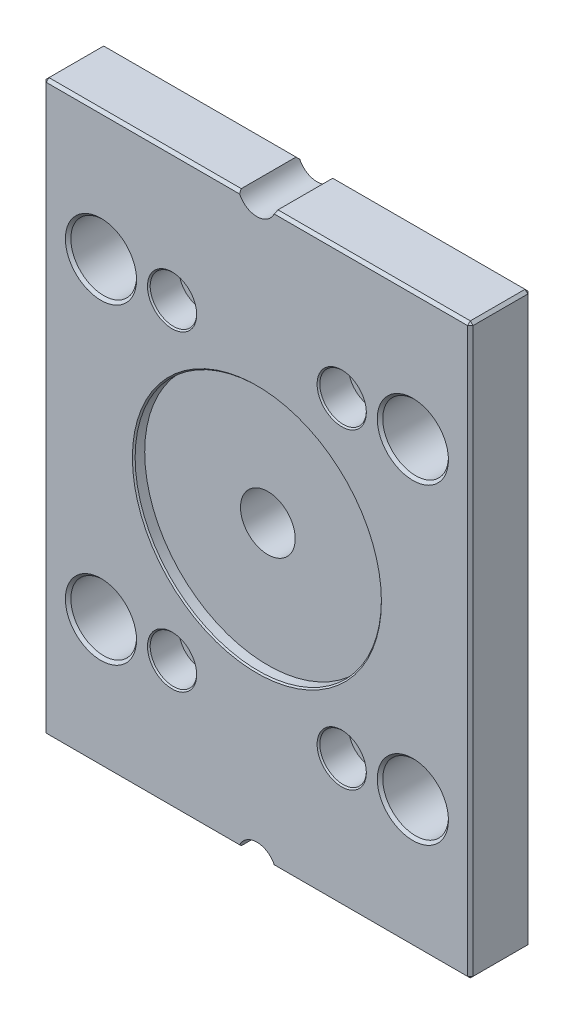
ISO-10303-21;
HEADER;
FILE_DESCRIPTION(('STEP AP214'),'2;1');
FILE_NAME('part.step','',(''),(''),'','','');
FILE_SCHEMA(('AUTOMOTIVE_DESIGN { 1 0 10303 214 1 1 1 1 }'));
ENDSEC;
DATA;
#1=APPLICATION_CONTEXT('core data for automotive mechanical design processes');
#2=APPLICATION_PROTOCOL_DEFINITION('international standard','automotive_design',2000,#1);
#3=PRODUCT_CONTEXT('',#1,'mechanical');
#4=PRODUCT('Part','Part','',(#3));
#5=PRODUCT_RELATED_PRODUCT_CATEGORY('part','',(#4));
#6=PRODUCT_DEFINITION_FORMATION('','',#4);
#7=PRODUCT_DEFINITION_CONTEXT('part definition',#1,'design');
#8=PRODUCT_DEFINITION('design','',#6,#7);
#9=PRODUCT_DEFINITION_SHAPE('','',#8);
#10=(LENGTH_UNIT() NAMED_UNIT(*) SI_UNIT(.MILLI.,.METRE.));
#11=(NAMED_UNIT(*) PLANE_ANGLE_UNIT() SI_UNIT($,.RADIAN.));
#12=(NAMED_UNIT(*) SI_UNIT($,.STERADIAN.) SOLID_ANGLE_UNIT());
#13=UNCERTAINTY_MEASURE_WITH_UNIT(LENGTH_MEASURE(1.E-05),#10,'distance_accuracy_value','');
#14=(GEOMETRIC_REPRESENTATION_CONTEXT(3) GLOBAL_UNCERTAINTY_ASSIGNED_CONTEXT((#13)) GLOBAL_UNIT_ASSIGNED_CONTEXT((#10,
#11,#12)) REPRESENTATION_CONTEXT('',''));
#15=CARTESIAN_POINT('',(0.,0.,0.));
#16=DIRECTION('',(0.,0.,1.));
#17=DIRECTION('',(1.,0.,0.));
#18=AXIS2_PLACEMENT_3D('',#15,#16,#17);
#19=CARTESIAN_POINT('',(0.499999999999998,0.499999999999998,21.));
#20=DIRECTION('',(-0.577350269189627,-0.577350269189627,0.577350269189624));
#21=DIRECTION('',(0.707106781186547,-0.707106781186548,0.));
#22=AXIS2_PLACEMENT_3D('',#19,#20,#21);
#23=PLANE('',#22);
#24=DIRECTION('',(0.707106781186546,0.,0.70710678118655));
#25=VECTOR('',#24,1.);
#26=CARTESIAN_POINT('',(0.499999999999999,0.999999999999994,21.5));
#27=LINE('',#26,#25);
#28=CARTESIAN_POINT('',(0.,0.999999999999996,21.));
#29=VERTEX_POINT('',#28);
#30=CARTESIAN_POINT('',(0.999999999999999,0.999999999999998,22.));
#31=VERTEX_POINT('',#30);
#32=EDGE_CURVE('E103',#29,#31,#27,.T.);
#33=ORIENTED_EDGE('',*,*,#32,.F.);
#34=DIRECTION('',(0.707106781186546,-0.707106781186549,0.));
#35=VECTOR('',#34,1.);
#36=CARTESIAN_POINT('',(0.499999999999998,0.5,21.));
#37=LINE('',#36,#35);
#38=CARTESIAN_POINT('',(1.,0.,21.));
#39=VERTEX_POINT('',#38);
#40=EDGE_CURVE('E383',#39,#29,#37,.F.);
#41=ORIENTED_EDGE('',*,*,#40,.F.);
#42=DIRECTION('',(0.,-0.707106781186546,-0.707106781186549));
#43=VECTOR('',#42,1.);
#44=CARTESIAN_POINT('',(1.,0.499999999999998,21.5));
#45=LINE('',#44,#43);
#46=EDGE_CURVE('E102',#31,#39,#45,.T.);
#47=ORIENTED_EDGE('',*,*,#46,.F.);
#48=EDGE_LOOP('',(#33,#41,#47));
#49=FACE_BOUND('',#48,.T.);
#50=ADVANCED_FACE('F17',(#49),#23,.T.);
#51=CARTESIAN_POINT('',(155.5,0.500000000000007,21.));
#52=DIRECTION('',(0.577350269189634,-0.577350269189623,0.577350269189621));
#53=DIRECTION('',(0.707106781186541,0.707106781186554,0.));
#54=AXIS2_PLACEMENT_3D('',#51,#52,#53);
#55=PLANE('',#54);
#56=DIRECTION('',(0.707106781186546,0.,-0.707106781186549));
#57=VECTOR('',#56,1.);
#58=CARTESIAN_POINT('',(155.5,1.,21.5));
#59=LINE('',#58,#57);
#60=CARTESIAN_POINT('',(155.,0.999999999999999,22.));
#61=VERTEX_POINT('',#60);
#62=CARTESIAN_POINT('',(156.,1.00000000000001,21.));
#63=VERTEX_POINT('',#62);
#64=EDGE_CURVE('E346',#61,#63,#59,.T.);
#65=ORIENTED_EDGE('',*,*,#64,.F.);
#66=DIRECTION('',(0.,-0.707106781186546,-0.707106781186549));
#67=VECTOR('',#66,1.);
#68=CARTESIAN_POINT('',(155.,0.499999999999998,21.5));
#69=LINE('',#68,#67);
#70=CARTESIAN_POINT('',(155.,0.,21.));
#71=VERTEX_POINT('',#70);
#72=EDGE_CURVE('E351',#71,#61,#69,.F.);
#73=ORIENTED_EDGE('',*,*,#72,.F.);
#74=DIRECTION('',(0.707106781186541,0.707106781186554,0.));
#75=VECTOR('',#74,1.);
#76=CARTESIAN_POINT('',(155.5,0.500000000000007,21.));
#77=LINE('',#76,#75);
#78=EDGE_CURVE('E378',#63,#71,#77,.F.);
#79=ORIENTED_EDGE('',*,*,#78,.F.);
#80=EDGE_LOOP('',(#65,#73,#79));
#81=FACE_BOUND('',#80,.T.);
#82=ADVANCED_FACE('F596',(#81),#55,.T.);
#83=CARTESIAN_POINT('',(0.500000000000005,207.5,21.));
#84=DIRECTION('',(-0.577350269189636,0.577350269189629,0.577350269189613));
#85=DIRECTION('',(-0.707106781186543,-0.707106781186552,0.));
#86=AXIS2_PLACEMENT_3D('',#83,#84,#85);
#87=PLANE('',#86);
#88=DIRECTION('',(0.,-0.70710678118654,0.707106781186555));
#89=VECTOR('',#88,1.);
#90=CARTESIAN_POINT('',(1.00000000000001,207.5,21.5));
#91=LINE('',#90,#89);
#92=CARTESIAN_POINT('',(1.,208.,21.));
#93=VERTEX_POINT('',#92);
#94=CARTESIAN_POINT('',(1.,207.,22.));
#95=VERTEX_POINT('',#94);
#96=EDGE_CURVE('E328',#93,#95,#91,.T.);
#97=ORIENTED_EDGE('',*,*,#96,.F.);
#98=DIRECTION('',(-0.707106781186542,-0.707106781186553,0.));
#99=VECTOR('',#98,1.);
#100=CARTESIAN_POINT('',(0.500000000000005,207.5,21.));
#101=LINE('',#100,#99);
#102=CARTESIAN_POINT('',(0.,207.,21.));
#103=VERTEX_POINT('',#102);
#104=EDGE_CURVE('E334',#103,#93,#101,.F.);
#105=ORIENTED_EDGE('',*,*,#104,.F.);
#106=DIRECTION('',(0.707106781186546,0.,0.70710678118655));
#107=VECTOR('',#106,1.);
#108=CARTESIAN_POINT('',(0.500000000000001,207.,21.5));
#109=LINE('',#108,#107);
#110=EDGE_CURVE('E368',#95,#103,#109,.F.);
#111=ORIENTED_EDGE('',*,*,#110,.F.);
#112=EDGE_LOOP('',(#97,#105,#111));
#113=FACE_BOUND('',#112,.T.);
#114=ADVANCED_FACE('F873',(#113),#87,.T.);
#115=CARTESIAN_POINT('',(155.5,207.5,21.));
#116=DIRECTION('',(0.577350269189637,0.577350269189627,0.577350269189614));
#117=DIRECTION('',(-0.707106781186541,0.707106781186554,0.));
#118=AXIS2_PLACEMENT_3D('',#115,#116,#117);
#119=PLANE('',#118);
#120=DIRECTION('',(0.,-0.70710678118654,0.707106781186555));
#121=VECTOR('',#120,1.);
#122=CARTESIAN_POINT('',(155.,207.5,21.5));
#123=LINE('',#122,#121);
#124=CARTESIAN_POINT('',(155.,207.,22.));
#125=VERTEX_POINT('',#124);
#126=CARTESIAN_POINT('',(155.,208.,21.));
#127=VERTEX_POINT('',#126);
#128=EDGE_CURVE('E320',#125,#127,#123,.F.);
#129=ORIENTED_EDGE('',*,*,#128,.F.);
#130=DIRECTION('',(0.707106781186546,0.,-0.707106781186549));
#131=VECTOR('',#130,1.);
#132=CARTESIAN_POINT('',(155.5,207.,21.5));
#133=LINE('',#132,#131);
#134=CARTESIAN_POINT('',(156.,207.,21.));
#135=VERTEX_POINT('',#134);
#136=EDGE_CURVE('E337',#135,#125,#133,.F.);
#137=ORIENTED_EDGE('',*,*,#136,.F.);
#138=DIRECTION('',(-0.707106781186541,0.707106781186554,0.));
#139=VECTOR('',#138,1.);
#140=CARTESIAN_POINT('',(155.5,207.5,21.));
#141=LINE('',#140,#139);
#142=EDGE_CURVE('E315',#127,#135,#141,.F.);
#143=ORIENTED_EDGE('',*,*,#142,.F.);
#144=EDGE_LOOP('',(#129,#137,#143));
#145=FACE_BOUND('',#144,.T.);
#146=ADVANCED_FACE('F697',(#145),#119,.T.);
#147=CARTESIAN_POINT('',(0.499999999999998,0.5,0.));
#148=DIRECTION('',(-0.707106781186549,-0.707106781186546,0.));
#149=DIRECTION('',(0.707106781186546,-0.707106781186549,0.));
#150=AXIS2_PLACEMENT_3D('',#147,#148,#149);
#151=PLANE('',#150);
#152=DIRECTION('',(0.707106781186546,-0.707106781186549,0.));
#153=VECTOR('',#152,1.);
#154=CARTESIAN_POINT('',(0.749999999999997,0.25,1.));
#155=LINE('',#154,#153);
#156=CARTESIAN_POINT('',(1.,0.,1.));
#157=VERTEX_POINT('',#156);
#158=CARTESIAN_POINT('',(0.,0.999999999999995,1.));
#159=VERTEX_POINT('',#158);
#160=EDGE_CURVE('E113',#157,#159,#155,.F.);
#161=ORIENTED_EDGE('',*,*,#160,.F.);
#162=DIRECTION('',(0.,0.,-1.));
#163=VECTOR('',#162,1.);
#164=CARTESIAN_POINT('',(1.,0.,0.));
#165=LINE('',#164,#163);
#166=EDGE_CURVE('E112',#39,#157,#165,.T.);
#167=ORIENTED_EDGE('',*,*,#166,.F.);
#168=ORIENTED_EDGE('',*,*,#40,.T.);
#169=DIRECTION('',(0.,0.,1.));
#170=VECTOR('',#169,1.);
#171=CARTESIAN_POINT('',(0.,0.999999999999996,0.));
#172=LINE('',#171,#170);
#173=EDGE_CURVE('E280',#159,#29,#172,.T.);
#174=ORIENTED_EDGE('',*,*,#173,.F.);
#175=EDGE_LOOP('',(#161,#167,#168,#174));
#176=FACE_BOUND('',#175,.T.);
#177=ADVANCED_FACE('F648',(#176),#151,.T.);
#178=CARTESIAN_POINT('',(155.5,0.500000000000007,0.));
#179=DIRECTION('',(0.707106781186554,-0.707106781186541,0.));
#180=DIRECTION('',(0.707106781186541,0.707106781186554,0.));
#181=AXIS2_PLACEMENT_3D('',#178,#179,#180);
#182=PLANE('',#181);
#183=DIRECTION('',(0.707106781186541,0.707106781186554,0.));
#184=VECTOR('',#183,1.);
#185=CARTESIAN_POINT('',(155.5,0.500000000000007,1.));
#186=LINE('',#185,#184);
#187=CARTESIAN_POINT('',(155.,0.,1.));
#188=VERTEX_POINT('',#187);
#189=CARTESIAN_POINT('',(156.,1.,1.));
#190=VERTEX_POINT('',#189);
#191=EDGE_CURVE('E373',#188,#190,#186,.T.);
#192=ORIENTED_EDGE('',*,*,#191,.T.);
#193=DIRECTION('',(0.,0.,-1.));
#194=VECTOR('',#193,1.);
#195=CARTESIAN_POINT('',(156.,1.,0.));
#196=LINE('',#195,#194);
#197=EDGE_CURVE('E224',#63,#190,#196,.T.);
#198=ORIENTED_EDGE('',*,*,#197,.F.);
#199=ORIENTED_EDGE('',*,*,#78,.T.);
#200=DIRECTION('',(0.,0.,-1.));
#201=VECTOR('',#200,1.);
#202=CARTESIAN_POINT('',(155.,0.,0.));
#203=LINE('',#202,#201);
#204=EDGE_CURVE('E249',#188,#71,#203,.F.);
#205=ORIENTED_EDGE('',*,*,#204,.F.);
#206=EDGE_LOOP('',(#192,#198,#199,#205));
#207=FACE_BOUND('',#206,.T.);
#208=ADVANCED_FACE('F587',(#207),#182,.T.);
#209=CARTESIAN_POINT('',(0.499999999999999,52.,21.5));
#210=DIRECTION('',(-0.70710678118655,0.,0.707106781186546));
#211=DIRECTION('',(0.707106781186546,0.,0.70710678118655));
#212=AXIS2_PLACEMENT_3D('',#209,#210,#211);
#213=PLANE('',#212);
#214=ORIENTED_EDGE('',*,*,#32,.T.);
#215=DIRECTION('',(0.,1.,0.));
#216=VECTOR('',#215,1.);
#217=CARTESIAN_POINT('',(1.,104.,22.));
#218=LINE('',#217,#216);
#219=EDGE_CURVE('E213',#95,#31,#218,.F.);
#220=ORIENTED_EDGE('',*,*,#219,.F.);
#221=ORIENTED_EDGE('',*,*,#110,.T.);
#222=DIRECTION('',(0.,1.,0.));
#223=VECTOR('',#222,1.);
#224=CARTESIAN_POINT('',(0.,0.,21.));
#225=LINE('',#224,#223);
#226=EDGE_CURVE('E270',#29,#103,#225,.T.);
#227=ORIENTED_EDGE('',*,*,#226,.F.);
#228=EDGE_LOOP('',(#214,#220,#221,#227));
#229=FACE_BOUND('',#228,.T.);
#230=ADVANCED_FACE('F642',(#229),#213,.T.);
#231=CARTESIAN_POINT('',(117.,0.499999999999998,21.5));
#232=DIRECTION('',(0.,-0.707106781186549,0.707106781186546));
#233=DIRECTION('',(0.,-0.707106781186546,-0.707106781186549));
#234=AXIS2_PLACEMENT_3D('',#231,#232,#233);
#235=PLANE('',#234);
#236=ORIENTED_EDGE('',*,*,#46,.T.);
#237=DIRECTION('',(1.,0.,0.));
#238=VECTOR('',#237,1.);
#239=CARTESIAN_POINT('',(156.,0.,21.));
#240=LINE('',#239,#238);
#241=CARTESIAN_POINT('',(71.2917960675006,0.,21.));
#242=VERTEX_POINT('',#241);
#243=EDGE_CURVE('E106',#242,#39,#240,.F.);
#244=ORIENTED_EDGE('',*,*,#243,.F.);
#245=CARTESIAN_POINT('',(78.,-1.99999999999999,19.));
#246=DIRECTION('',(0.,-0.707106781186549,0.707106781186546));
#247=DIRECTION('',(0.,-0.707106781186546,-0.707106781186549));
#248=AXIS2_PLACEMENT_3D('',#245,#246,#247);
#249=ELLIPSE('',#248,9.89949493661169,7.);
#250=CARTESIAN_POINT('',(71.6754446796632,0.999999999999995,22.));
#251=VERTEX_POINT('',#250);
#252=EDGE_CURVE('E20',#242,#251,#249,.F.);
#253=ORIENTED_EDGE('',*,*,#252,.T.);
#254=DIRECTION('',(1.,0.,0.));
#255=VECTOR('',#254,1.);
#256=CARTESIAN_POINT('',(78.,1.,22.));
#257=LINE('',#256,#255);
#258=EDGE_CURVE('E209',#31,#251,#257,.T.);
#259=ORIENTED_EDGE('',*,*,#258,.F.);
#260=EDGE_LOOP('',(#236,#244,#253,#259));
#261=FACE_BOUND('',#260,.T.);
#262=ADVANCED_FACE('F107',(#261),#235,.T.);
#263=CARTESIAN_POINT('',(117.,0.499999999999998,21.5));
#264=DIRECTION('',(0.,-0.707106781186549,0.707106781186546));
#265=DIRECTION('',(0.,-0.707106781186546,-0.707106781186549));
#266=AXIS2_PLACEMENT_3D('',#263,#264,#265);
#267=PLANE('',#266);
#268=ORIENTED_EDGE('',*,*,#72,.T.);
#269=DIRECTION('',(1.,0.,0.));
#270=VECTOR('',#269,1.);
#271=CARTESIAN_POINT('',(78.,1.,22.));
#272=LINE('',#271,#270);
#273=CARTESIAN_POINT('',(84.3245553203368,0.999999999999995,22.));
#274=VERTEX_POINT('',#273);
#275=EDGE_CURVE('E206',#274,#61,#272,.T.);
#276=ORIENTED_EDGE('',*,*,#275,.F.);
#277=CARTESIAN_POINT('',(78.,-1.99999999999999,19.));
#278=DIRECTION('',(0.,-0.707106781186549,0.707106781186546));
#279=DIRECTION('',(0.,-0.707106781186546,-0.707106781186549));
#280=AXIS2_PLACEMENT_3D('',#277,#278,#279);
#281=ELLIPSE('',#280,9.89949493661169,7.);
#282=CARTESIAN_POINT('',(84.7082039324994,0.,21.));
#283=VERTEX_POINT('',#282);
#284=EDGE_CURVE('E356',#274,#283,#281,.F.);
#285=ORIENTED_EDGE('',*,*,#284,.T.);
#286=DIRECTION('',(1.,0.,0.));
#287=VECTOR('',#286,1.);
#288=CARTESIAN_POINT('',(156.,0.,21.));
#289=LINE('',#288,#287);
#290=EDGE_CURVE('E246',#71,#283,#289,.F.);
#291=ORIENTED_EDGE('',*,*,#290,.F.);
#292=EDGE_LOOP('',(#268,#276,#285,#291));
#293=FACE_BOUND('',#292,.T.);
#294=ADVANCED_FACE('F498',(#293),#267,.T.);
#295=CARTESIAN_POINT('',(155.5,156.,21.5));
#296=DIRECTION('',(0.707106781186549,0.,0.707106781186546));
#297=DIRECTION('',(0.707106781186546,0.,-0.707106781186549));
#298=AXIS2_PLACEMENT_3D('',#295,#296,#297);
#299=PLANE('',#298);
#300=ORIENTED_EDGE('',*,*,#136,.T.);
#301=DIRECTION('',(0.,1.,0.));
#302=VECTOR('',#301,1.);
#303=CARTESIAN_POINT('',(155.,104.,22.));
#304=LINE('',#303,#302);
#305=EDGE_CURVE('E203',#61,#125,#304,.T.);
#306=ORIENTED_EDGE('',*,*,#305,.F.);
#307=ORIENTED_EDGE('',*,*,#64,.T.);
#308=DIRECTION('',(0.,1.,0.));
#309=VECTOR('',#308,1.);
#310=CARTESIAN_POINT('',(156.,208.,21.));
#311=LINE('',#310,#309);
#312=EDGE_CURVE('E240',#135,#63,#311,.F.);
#313=ORIENTED_EDGE('',*,*,#312,.F.);
#314=EDGE_LOOP('',(#300,#306,#307,#313));
#315=FACE_BOUND('',#314,.T.);
#316=ADVANCED_FACE('F693',(#315),#299,.T.);
#317=CARTESIAN_POINT('',(109.,47.,22.0000000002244));
#318=DIRECTION('',(0.,0.,1.));
#319=DIRECTION('',(1.,0.,0.));
#320=AXIS2_PLACEMENT_3D('',#317,#318,#319);
#321=CONICAL_SURFACE('',#320,8.99999999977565,0.785398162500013);
#322=CARTESIAN_POINT('',(109.,47.,22.0000000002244));
#323=DIRECTION('',(0.,0.,1.));
#324=DIRECTION('',(1.,0.,0.));
#325=AXIS2_PLACEMENT_3D('',#322,#323,#324);
#326=CIRCLE('',#325,8.99999999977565);
#327=CARTESIAN_POINT('',(117.999999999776,47.,22.0000000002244));
#328=VERTEX_POINT('',#327);
#329=EDGE_CURVE('E202',#328,#328,#326,.F.);
#330=ORIENTED_EDGE('',*,*,#329,.F.);
#331=EDGE_LOOP('',(#330));
#332=FACE_BOUND('',#331,.T.);
#333=CARTESIAN_POINT('',(109.,47.,21.5));
#334=DIRECTION('',(0.,0.,1.));
#335=DIRECTION('',(1.,0.,0.));
#336=AXIS2_PLACEMENT_3D('',#333,#334,#335);
#337=CIRCLE('',#336,8.5);
#338=CARTESIAN_POINT('',(117.5,47.,21.5));
#339=VERTEX_POINT('',#338);
#340=EDGE_CURVE('E305',#339,#339,#337,.F.);
#341=ORIENTED_EDGE('',*,*,#340,.T.);
#342=EDGE_LOOP('',(#341));
#343=FACE_BOUND('',#342,.T.);
#344=ADVANCED_FACE('F854',(#332,#343),#321,.F.);
#345=CARTESIAN_POINT('',(109.,161.,22.0000000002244));
#346=DIRECTION('',(0.,0.,1.));
#347=DIRECTION('',(1.,0.,0.));
#348=AXIS2_PLACEMENT_3D('',#345,#346,#347);
#349=CONICAL_SURFACE('',#348,8.99999999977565,0.785398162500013);
#350=CARTESIAN_POINT('',(109.,161.,22.0000000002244));
#351=DIRECTION('',(0.,0.,1.));
#352=DIRECTION('',(1.,0.,0.));
#353=AXIS2_PLACEMENT_3D('',#350,#351,#352);
#354=CIRCLE('',#353,8.99999999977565);
#355=CARTESIAN_POINT('',(117.999999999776,161.,22.0000000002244));
#356=VERTEX_POINT('',#355);
#357=EDGE_CURVE('E489',#356,#356,#354,.F.);
#358=ORIENTED_EDGE('',*,*,#357,.F.);
#359=EDGE_LOOP('',(#358));
#360=FACE_BOUND('',#359,.T.);
#361=CARTESIAN_POINT('',(109.,161.,21.5));
#362=DIRECTION('',(0.,0.,1.));
#363=DIRECTION('',(1.,0.,0.));
#364=AXIS2_PLACEMENT_3D('',#361,#362,#363);
#365=CIRCLE('',#364,8.5);
#366=CARTESIAN_POINT('',(117.5,161.,21.5));
#367=VERTEX_POINT('',#366);
#368=EDGE_CURVE('E310',#367,#367,#365,.F.);
#369=ORIENTED_EDGE('',*,*,#368,.T.);
#370=EDGE_LOOP('',(#369));
#371=FACE_BOUND('',#370,.T.);
#372=ADVANCED_FACE('F850',(#360,#371),#349,.F.);
#373=CARTESIAN_POINT('',(47.,47.,22.0000000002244));
#374=DIRECTION('',(0.,0.,1.));
#375=DIRECTION('',(1.,0.,0.));
#376=AXIS2_PLACEMENT_3D('',#373,#374,#375);
#377=CONICAL_SURFACE('',#376,8.99999999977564,0.785398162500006);
#378=CARTESIAN_POINT('',(47.,47.,22.0000000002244));
#379=DIRECTION('',(0.,0.,1.));
#380=DIRECTION('',(1.,0.,0.));
#381=AXIS2_PLACEMENT_3D('',#378,#379,#380);
#382=CIRCLE('',#381,8.99999999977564);
#383=CARTESIAN_POINT('',(55.9999999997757,47.,22.0000000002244));
#384=VERTEX_POINT('',#383);
#385=EDGE_CURVE('E486',#384,#384,#382,.F.);
#386=ORIENTED_EDGE('',*,*,#385,.F.);
#387=EDGE_LOOP('',(#386));
#388=FACE_BOUND('',#387,.T.);
#389=CARTESIAN_POINT('',(47.,47.,21.5));
#390=DIRECTION('',(0.,0.,1.));
#391=DIRECTION('',(1.,0.,0.));
#392=AXIS2_PLACEMENT_3D('',#389,#390,#391);
#393=CIRCLE('',#392,8.5);
#394=CARTESIAN_POINT('',(55.5,47.,21.5));
#395=VERTEX_POINT('',#394);
#396=EDGE_CURVE('E300',#395,#395,#393,.F.);
#397=ORIENTED_EDGE('',*,*,#396,.T.);
#398=EDGE_LOOP('',(#397));
#399=FACE_BOUND('',#398,.T.);
#400=ADVANCED_FACE('F846',(#388,#399),#377,.F.);
#401=CARTESIAN_POINT('',(78.,104.,22.0000000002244));
#402=DIRECTION('',(0.,0.,1.));
#403=DIRECTION('',(1.,0.,0.));
#404=AXIS2_PLACEMENT_3D('',#401,#402,#403);
#405=CONICAL_SURFACE('',#404,45.5087499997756,0.7853981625);
#406=CARTESIAN_POINT('',(78.,104.,22.0000000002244));
#407=DIRECTION('',(0.,0.,1.));
#408=DIRECTION('',(1.,0.,0.));
#409=AXIS2_PLACEMENT_3D('',#406,#407,#408);
#410=CIRCLE('',#409,45.5087499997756);
#411=CARTESIAN_POINT('',(123.508749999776,104.,22.0000000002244));
#412=VERTEX_POINT('',#411);
#413=EDGE_CURVE('E471',#412,#412,#410,.F.);
#414=ORIENTED_EDGE('',*,*,#413,.F.);
#415=EDGE_LOOP('',(#414));
#416=FACE_BOUND('',#415,.T.);
#417=CARTESIAN_POINT('',(78.,104.,21.5));
#418=DIRECTION('',(0.,0.,1.));
#419=DIRECTION('',(1.,0.,0.));
#420=AXIS2_PLACEMENT_3D('',#417,#418,#419);
#421=CIRCLE('',#420,45.00875);
#422=CARTESIAN_POINT('',(123.00875,104.,21.5));
#423=VERTEX_POINT('',#422);
#424=EDGE_CURVE('E281',#423,#423,#421,.F.);
#425=ORIENTED_EDGE('',*,*,#424,.T.);
#426=EDGE_LOOP('',(#425));
#427=FACE_BOUND('',#426,.T.);
#428=ADVANCED_FACE('F842',(#416,#427),#405,.F.);
#429=CARTESIAN_POINT('',(47.,161.,22.0000000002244));
#430=DIRECTION('',(0.,0.,1.));
#431=DIRECTION('',(1.,0.,0.));
#432=AXIS2_PLACEMENT_3D('',#429,#430,#431);
#433=CONICAL_SURFACE('',#432,8.99999999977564,0.785398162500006);
#434=CARTESIAN_POINT('',(47.,161.,22.0000000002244));
#435=DIRECTION('',(0.,0.,1.));
#436=DIRECTION('',(1.,0.,0.));
#437=AXIS2_PLACEMENT_3D('',#434,#435,#436);
#438=CIRCLE('',#437,8.99999999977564);
#439=CARTESIAN_POINT('',(55.9999999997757,161.,22.0000000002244));
#440=VERTEX_POINT('',#439);
#441=EDGE_CURVE('E290',#440,#440,#438,.F.);
#442=ORIENTED_EDGE('',*,*,#441,.F.);
#443=EDGE_LOOP('',(#442));
#444=FACE_BOUND('',#443,.T.);
#445=CARTESIAN_POINT('',(47.,161.,21.5));
#446=DIRECTION('',(0.,0.,1.));
#447=DIRECTION('',(1.,0.,0.));
#448=AXIS2_PLACEMENT_3D('',#445,#446,#447);
#449=CIRCLE('',#448,8.5);
#450=CARTESIAN_POINT('',(55.5,161.,21.5));
#451=VERTEX_POINT('',#450);
#452=EDGE_CURVE('E295',#451,#451,#449,.F.);
#453=ORIENTED_EDGE('',*,*,#452,.T.);
#454=EDGE_LOOP('',(#453));
#455=FACE_BOUND('',#454,.T.);
#456=ADVANCED_FACE('F839',(#444,#455),#433,.F.);
#457=CARTESIAN_POINT('',(0.500000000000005,207.5,0.));
#458=DIRECTION('',(-0.707106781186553,0.707106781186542,0.));
#459=DIRECTION('',(-0.707106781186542,-0.707106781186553,0.));
#460=AXIS2_PLACEMENT_3D('',#457,#458,#459);
#461=PLANE('',#460);
#462=DIRECTION('',(-0.707106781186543,-0.707106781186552,0.));
#463=VECTOR('',#462,1.);
#464=CARTESIAN_POINT('',(0.750000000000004,207.75,1.00000000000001));
#465=LINE('',#464,#463);
#466=CARTESIAN_POINT('',(0.,207.,1.));
#467=VERTEX_POINT('',#466);
#468=CARTESIAN_POINT('',(1.,208.,1.00000000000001));
#469=VERTEX_POINT('',#468);
#470=EDGE_CURVE('E262',#467,#469,#465,.F.);
#471=ORIENTED_EDGE('',*,*,#470,.F.);
#472=DIRECTION('',(0.,0.,1.));
#473=VECTOR('',#472,1.);
#474=CARTESIAN_POINT('',(0.,207.,0.));
#475=LINE('',#474,#473);
#476=EDGE_CURVE('E277',#103,#467,#475,.F.);
#477=ORIENTED_EDGE('',*,*,#476,.F.);
#478=ORIENTED_EDGE('',*,*,#104,.T.);
#479=DIRECTION('',(0.,0.,1.));
#480=VECTOR('',#479,1.);
#481=CARTESIAN_POINT('',(1.,208.,0.));
#482=LINE('',#481,#480);
#483=EDGE_CURVE('E196',#469,#93,#482,.T.);
#484=ORIENTED_EDGE('',*,*,#483,.F.);
#485=EDGE_LOOP('',(#471,#477,#478,#484));
#486=FACE_BOUND('',#485,.T.);
#487=ADVANCED_FACE('F669',(#486),#461,.T.);
#488=CARTESIAN_POINT('',(39.,207.5,21.5));
#489=DIRECTION('',(0.,0.707106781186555,0.70710678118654));
#490=DIRECTION('',(0.,-0.70710678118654,0.707106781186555));
#491=AXIS2_PLACEMENT_3D('',#488,#489,#490);
#492=PLANE('',#491);
#493=ORIENTED_EDGE('',*,*,#96,.T.);
#494=DIRECTION('',(1.,0.,0.));
#495=VECTOR('',#494,1.);
#496=CARTESIAN_POINT('',(78.,207.,22.));
#497=LINE('',#496,#495);
#498=CARTESIAN_POINT('',(71.6754446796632,207.,22.));
#499=VERTEX_POINT('',#498);
#500=EDGE_CURVE('E216',#499,#95,#497,.F.);
#501=ORIENTED_EDGE('',*,*,#500,.F.);
#502=CARTESIAN_POINT('',(78.,210.,19.));
#503=DIRECTION('',(0.,0.707106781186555,0.70710678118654));
#504=DIRECTION('',(0.,0.70710678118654,-0.707106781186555));
#505=AXIS2_PLACEMENT_3D('',#502,#503,#504);
#506=ELLIPSE('',#505,9.89949493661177,7.);
#507=CARTESIAN_POINT('',(71.2917960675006,208.,21.));
#508=VERTEX_POINT('',#507);
#509=EDGE_CURVE('E331',#499,#508,#506,.F.);
#510=ORIENTED_EDGE('',*,*,#509,.T.);
#511=DIRECTION('',(1.,0.,0.));
#512=VECTOR('',#511,1.);
#513=CARTESIAN_POINT('',(0.,208.,21.));
#514=LINE('',#513,#512);
#515=EDGE_CURVE('E191',#93,#508,#514,.T.);
#516=ORIENTED_EDGE('',*,*,#515,.F.);
#517=EDGE_LOOP('',(#493,#501,#510,#516));
#518=FACE_BOUND('',#517,.T.);
#519=ADVANCED_FACE('F833',(#518),#492,.T.);
#520=CARTESIAN_POINT('',(39.,207.5,21.5));
#521=DIRECTION('',(0.,0.707106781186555,0.70710678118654));
#522=DIRECTION('',(0.,-0.70710678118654,0.707106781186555));
#523=AXIS2_PLACEMENT_3D('',#520,#521,#522);
#524=PLANE('',#523);
#525=ORIENTED_EDGE('',*,*,#128,.T.);
#526=DIRECTION('',(1.,0.,0.));
#527=VECTOR('',#526,1.);
#528=CARTESIAN_POINT('',(0.,208.,21.));
#529=LINE('',#528,#527);
#530=CARTESIAN_POINT('',(84.7082039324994,208.,21.));
#531=VERTEX_POINT('',#530);
#532=EDGE_CURVE('E188',#531,#127,#529,.T.);
#533=ORIENTED_EDGE('',*,*,#532,.F.);
#534=CARTESIAN_POINT('',(78.,210.,19.));
#535=DIRECTION('',(0.,0.707106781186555,0.70710678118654));
#536=DIRECTION('',(0.,0.70710678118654,-0.707106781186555));
#537=AXIS2_PLACEMENT_3D('',#534,#535,#536);
#538=ELLIPSE('',#537,9.89949493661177,7.);
#539=CARTESIAN_POINT('',(84.3245553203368,207.,22.));
#540=VERTEX_POINT('',#539);
#541=EDGE_CURVE('E325',#531,#540,#538,.F.);
#542=ORIENTED_EDGE('',*,*,#541,.T.);
#543=DIRECTION('',(1.,0.,0.));
#544=VECTOR('',#543,1.);
#545=CARTESIAN_POINT('',(78.,207.,22.));
#546=LINE('',#545,#544);
#547=EDGE_CURVE('E199',#125,#540,#546,.F.);
#548=ORIENTED_EDGE('',*,*,#547,.F.);
#549=EDGE_LOOP('',(#525,#533,#542,#548));
#550=FACE_BOUND('',#549,.T.);
#551=ADVANCED_FACE('F700',(#550),#524,.T.);
#552=CARTESIAN_POINT('',(155.5,207.5,0.));
#553=DIRECTION('',(0.707106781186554,0.707106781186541,0.));
#554=DIRECTION('',(-0.707106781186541,0.707106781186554,0.));
#555=AXIS2_PLACEMENT_3D('',#552,#553,#554);
#556=PLANE('',#555);
#557=DIRECTION('',(-0.707106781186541,0.707106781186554,0.));
#558=VECTOR('',#557,1.);
#559=CARTESIAN_POINT('',(155.75,207.25,1.));
#560=LINE('',#559,#558);
#561=CARTESIAN_POINT('',(155.,208.,0.999999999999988));
#562=VERTEX_POINT('',#561);
#563=CARTESIAN_POINT('',(156.,207.,0.999999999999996));
#564=VERTEX_POINT('',#563);
#565=EDGE_CURVE('E219',#562,#564,#560,.F.);
#566=ORIENTED_EDGE('',*,*,#565,.F.);
#567=DIRECTION('',(0.,0.,1.));
#568=VECTOR('',#567,1.);
#569=CARTESIAN_POINT('',(155.,208.,0.));
#570=LINE('',#569,#568);
#571=EDGE_CURVE('E185',#127,#562,#570,.F.);
#572=ORIENTED_EDGE('',*,*,#571,.F.);
#573=ORIENTED_EDGE('',*,*,#142,.T.);
#574=DIRECTION('',(0.,0.,-1.));
#575=VECTOR('',#574,1.);
#576=CARTESIAN_POINT('',(156.,207.,0.));
#577=LINE('',#576,#575);
#578=EDGE_CURVE('E243',#564,#135,#577,.F.);
#579=ORIENTED_EDGE('',*,*,#578,.F.);
#580=EDGE_LOOP('',(#566,#572,#573,#579));
#581=FACE_BOUND('',#580,.T.);
#582=ADVANCED_FACE('F687',(#581),#556,.T.);
#583=CARTESIAN_POINT('',(135.,161.,22.0000000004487));
#584=DIRECTION('',(0.,0.,1.));
#585=DIRECTION('',(1.,0.,0.));
#586=AXIS2_PLACEMENT_3D('',#583,#584,#585);
#587=CONICAL_SURFACE('',#586,13.0052499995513,0.785398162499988);
#588=CARTESIAN_POINT('',(135.,161.,22.0000000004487));
#589=DIRECTION('',(0.,0.,1.));
#590=DIRECTION('',(1.,0.,0.));
#591=AXIS2_PLACEMENT_3D('',#588,#589,#590);
#592=CIRCLE('',#591,13.0052499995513);
#593=CARTESIAN_POINT('',(148.005249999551,161.,22.0000000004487));
#594=VERTEX_POINT('',#593);
#595=EDGE_CURVE('E483',#594,#594,#592,.F.);
#596=ORIENTED_EDGE('',*,*,#595,.F.);
#597=EDGE_LOOP('',(#596));
#598=FACE_BOUND('',#597,.T.);
#599=CARTESIAN_POINT('',(135.,161.,21.));
#600=DIRECTION('',(0.,0.,1.));
#601=DIRECTION('',(1.,0.,0.));
#602=AXIS2_PLACEMENT_3D('',#599,#600,#601);
#603=CIRCLE('',#602,12.00525);
#604=CARTESIAN_POINT('',(147.00525,161.,21.));
#605=VERTEX_POINT('',#604);
#606=EDGE_CURVE('E180',#605,#605,#603,.F.);
#607=ORIENTED_EDGE('',*,*,#606,.T.);
#608=EDGE_LOOP('',(#607));
#609=FACE_BOUND('',#608,.T.);
#610=ADVANCED_FACE('F814',(#598,#609),#587,.F.);
#611=CARTESIAN_POINT('',(21.,47.,22.0000000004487));
#612=DIRECTION('',(0.,0.,1.));
#613=DIRECTION('',(1.,0.,0.));
#614=AXIS2_PLACEMENT_3D('',#611,#612,#613);
#615=CONICAL_SURFACE('',#614,13.0052499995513,0.785398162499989);
#616=CARTESIAN_POINT('',(21.,47.,22.0000000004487));
#617=DIRECTION('',(0.,0.,1.));
#618=DIRECTION('',(1.,0.,0.));
#619=AXIS2_PLACEMENT_3D('',#616,#617,#618);
#620=CIRCLE('',#619,13.0052499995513);
#621=CARTESIAN_POINT('',(34.0052499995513,47.,22.0000000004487));
#622=VERTEX_POINT('',#621);
#623=EDGE_CURVE('E480',#622,#622,#620,.F.);
#624=ORIENTED_EDGE('',*,*,#623,.F.);
#625=EDGE_LOOP('',(#624));
#626=FACE_BOUND('',#625,.T.);
#627=CARTESIAN_POINT('',(21.,47.,21.));
#628=DIRECTION('',(0.,0.,1.));
#629=DIRECTION('',(1.,0.,0.));
#630=AXIS2_PLACEMENT_3D('',#627,#628,#629);
#631=CIRCLE('',#630,12.00525);
#632=CARTESIAN_POINT('',(33.00525,47.,21.));
#633=VERTEX_POINT('',#632);
#634=EDGE_CURVE('E176',#633,#633,#631,.F.);
#635=ORIENTED_EDGE('',*,*,#634,.T.);
#636=EDGE_LOOP('',(#635));
#637=FACE_BOUND('',#636,.T.);
#638=ADVANCED_FACE('F811',(#626,#637),#615,.F.);
#639=CARTESIAN_POINT('',(109.,161.,16.5));
#640=DIRECTION('',(0.,0.,1.));
#641=DIRECTION('',(1.,0.,0.));
#642=AXIS2_PLACEMENT_3D('',#639,#640,#641);
#643=CYLINDRICAL_SURFACE('',#642,8.5);
#644=ORIENTED_EDGE('',*,*,#368,.F.);
#645=EDGE_LOOP('',(#644));
#646=FACE_BOUND('',#645,.T.);
#647=CARTESIAN_POINT('',(109.,161.,11.));
#648=DIRECTION('',(0.,0.,1.));
#649=DIRECTION('',(1.,0.,0.));
#650=AXIS2_PLACEMENT_3D('',#647,#648,#649);
#651=CIRCLE('',#650,8.5);
#652=CARTESIAN_POINT('',(117.5,161.,11.));
#653=VERTEX_POINT('',#652);
#654=EDGE_CURVE('E179',#653,#653,#651,.T.);
#655=ORIENTED_EDGE('',*,*,#654,.F.);
#656=EDGE_LOOP('',(#655));
#657=FACE_BOUND('',#656,.T.);
#658=ADVANCED_FACE('F813',(#646,#657),#643,.F.);
#659=CARTESIAN_POINT('',(109.,47.,16.5));
#660=DIRECTION('',(0.,0.,1.));
#661=DIRECTION('',(1.,0.,0.));
#662=AXIS2_PLACEMENT_3D('',#659,#660,#661);
#663=CYLINDRICAL_SURFACE('',#662,8.5);
#664=ORIENTED_EDGE('',*,*,#340,.F.);
#665=EDGE_LOOP('',(#664));
#666=FACE_BOUND('',#665,.T.);
#667=CARTESIAN_POINT('',(109.,47.,11.));
#668=DIRECTION('',(0.,0.,1.));
#669=DIRECTION('',(1.,0.,0.));
#670=AXIS2_PLACEMENT_3D('',#667,#668,#669);
#671=CIRCLE('',#670,8.5);
#672=CARTESIAN_POINT('',(117.5,47.,11.));
#673=VERTEX_POINT('',#672);
#674=EDGE_CURVE('E464',#673,#673,#671,.T.);
#675=ORIENTED_EDGE('',*,*,#674,.F.);
#676=EDGE_LOOP('',(#675));
#677=FACE_BOUND('',#676,.T.);
#678=ADVANCED_FACE('F821',(#666,#677),#663,.F.);
#679=CARTESIAN_POINT('',(47.,47.,16.5));
#680=DIRECTION('',(0.,0.,1.));
#681=DIRECTION('',(1.,0.,0.));
#682=AXIS2_PLACEMENT_3D('',#679,#680,#681);
#683=CYLINDRICAL_SURFACE('',#682,8.5);
#684=ORIENTED_EDGE('',*,*,#396,.F.);
#685=EDGE_LOOP('',(#684));
#686=FACE_BOUND('',#685,.T.);
#687=CARTESIAN_POINT('',(47.,47.,11.));
#688=DIRECTION('',(0.,0.,1.));
#689=DIRECTION('',(1.,0.,0.));
#690=AXIS2_PLACEMENT_3D('',#687,#688,#689);
#691=CIRCLE('',#690,8.5);
#692=CARTESIAN_POINT('',(55.5,47.,11.));
#693=VERTEX_POINT('',#692);
#694=EDGE_CURVE('E461',#693,#693,#691,.T.);
#695=ORIENTED_EDGE('',*,*,#694,.F.);
#696=EDGE_LOOP('',(#695));
#697=FACE_BOUND('',#696,.T.);
#698=ADVANCED_FACE('F974',(#686,#697),#683,.F.);
#699=CARTESIAN_POINT('',(47.,161.,16.5));
#700=DIRECTION('',(0.,0.,1.));
#701=DIRECTION('',(1.,0.,0.));
#702=AXIS2_PLACEMENT_3D('',#699,#700,#701);
#703=CYLINDRICAL_SURFACE('',#702,8.5);
#704=ORIENTED_EDGE('',*,*,#452,.F.);
#705=EDGE_LOOP('',(#704));
#706=FACE_BOUND('',#705,.T.);
#707=CARTESIAN_POINT('',(47.,161.,11.));
#708=DIRECTION('',(0.,0.,1.));
#709=DIRECTION('',(1.,0.,0.));
#710=AXIS2_PLACEMENT_3D('',#707,#708,#709);
#711=CIRCLE('',#710,8.5);
#712=CARTESIAN_POINT('',(55.5,161.,11.));
#713=VERTEX_POINT('',#712);
#714=EDGE_CURVE('E458',#713,#713,#711,.T.);
#715=ORIENTED_EDGE('',*,*,#714,.F.);
#716=EDGE_LOOP('',(#715));
#717=FACE_BOUND('',#716,.T.);
#718=ADVANCED_FACE('F981',(#706,#717),#703,.F.);
#719=CARTESIAN_POINT('',(78.,104.,20.));
#720=DIRECTION('',(0.,0.,1.));
#721=DIRECTION('',(1.,0.,0.));
#722=AXIS2_PLACEMENT_3D('',#719,#720,#721);
#723=CYLINDRICAL_SURFACE('',#722,45.00875);
#724=ORIENTED_EDGE('',*,*,#424,.F.);
#725=EDGE_LOOP('',(#724));
#726=FACE_BOUND('',#725,.T.);
#727=CARTESIAN_POINT('',(78.,104.,18.));
#728=DIRECTION('',(0.,0.,1.));
#729=DIRECTION('',(1.,0.,0.));
#730=AXIS2_PLACEMENT_3D('',#727,#728,#729);
#731=CIRCLE('',#730,45.00875);
#732=CARTESIAN_POINT('',(123.00875,104.,18.));
#733=VERTEX_POINT('',#732);
#734=EDGE_CURVE('E173',#733,#733,#731,.T.);
#735=ORIENTED_EDGE('',*,*,#734,.F.);
#736=EDGE_LOOP('',(#735));
#737=FACE_BOUND('',#736,.T.);
#738=ADVANCED_FACE('F989',(#726,#737),#723,.F.);
#739=CARTESIAN_POINT('',(135.,47.,22.0000000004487));
#740=DIRECTION('',(0.,0.,1.));
#741=DIRECTION('',(1.,0.,0.));
#742=AXIS2_PLACEMENT_3D('',#739,#740,#741);
#743=CONICAL_SURFACE('',#742,13.0052499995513,0.785398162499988);
#744=CARTESIAN_POINT('',(135.,47.,22.0000000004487));
#745=DIRECTION('',(0.,0.,1.));
#746=DIRECTION('',(1.,0.,0.));
#747=AXIS2_PLACEMENT_3D('',#744,#745,#746);
#748=CIRCLE('',#747,13.0052499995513);
#749=CARTESIAN_POINT('',(148.005249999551,47.,22.0000000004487));
#750=VERTEX_POINT('',#749);
#751=EDGE_CURVE('E477',#750,#750,#748,.F.);
#752=ORIENTED_EDGE('',*,*,#751,.F.);
#753=EDGE_LOOP('',(#752));
#754=FACE_BOUND('',#753,.T.);
#755=CARTESIAN_POINT('',(135.,47.,21.));
#756=DIRECTION('',(0.,0.,1.));
#757=DIRECTION('',(1.,0.,0.));
#758=AXIS2_PLACEMENT_3D('',#755,#756,#757);
#759=CIRCLE('',#758,12.00525);
#760=CARTESIAN_POINT('',(147.00525,47.,21.));
#761=VERTEX_POINT('',#760);
#762=EDGE_CURVE('E168',#761,#761,#759,.F.);
#763=ORIENTED_EDGE('',*,*,#762,.T.);
#764=EDGE_LOOP('',(#763));
#765=FACE_BOUND('',#764,.T.);
#766=ADVANCED_FACE('F997',(#754,#765),#743,.F.);
#767=CARTESIAN_POINT('',(21.,161.,22.0000000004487));
#768=DIRECTION('',(0.,0.,1.));
#769=DIRECTION('',(1.,0.,0.));
#770=AXIS2_PLACEMENT_3D('',#767,#768,#769);
#771=CONICAL_SURFACE('',#770,13.0052499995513,0.785398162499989);
#772=CARTESIAN_POINT('',(21.,161.,22.0000000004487));
#773=DIRECTION('',(0.,0.,1.));
#774=DIRECTION('',(1.,0.,0.));
#775=AXIS2_PLACEMENT_3D('',#772,#773,#774);
#776=CIRCLE('',#775,13.0052499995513);
#777=CARTESIAN_POINT('',(34.0052499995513,161.,22.0000000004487));
#778=VERTEX_POINT('',#777);
#779=EDGE_CURVE('E474',#778,#778,#776,.F.);
#780=ORIENTED_EDGE('',*,*,#779,.F.);
#781=EDGE_LOOP('',(#780));
#782=FACE_BOUND('',#781,.T.);
#783=CARTESIAN_POINT('',(21.,161.,21.));
#784=DIRECTION('',(0.,0.,1.));
#785=DIRECTION('',(1.,0.,0.));
#786=AXIS2_PLACEMENT_3D('',#783,#784,#785);
#787=CIRCLE('',#786,12.00525);
#788=CARTESIAN_POINT('',(33.00525,161.,21.));
#789=VERTEX_POINT('',#788);
#790=EDGE_CURVE('E163',#789,#789,#787,.F.);
#791=ORIENTED_EDGE('',*,*,#790,.T.);
#792=EDGE_LOOP('',(#791));
#793=FACE_BOUND('',#792,.T.);
#794=ADVANCED_FACE('F1005',(#782,#793),#771,.F.);
#795=CARTESIAN_POINT('',(0.,0.,0.));
#796=DIRECTION('',(-1.,0.,0.));
#797=DIRECTION('',(0.,0.,1.));
#798=AXIS2_PLACEMENT_3D('',#795,#796,#797);
#799=PLANE('',#798);
#800=ORIENTED_EDGE('',*,*,#173,.T.);
#801=ORIENTED_EDGE('',*,*,#226,.T.);
#802=ORIENTED_EDGE('',*,*,#476,.T.);
#803=DIRECTION('',(0.,1.,0.));
#804=VECTOR('',#803,1.);
#805=CARTESIAN_POINT('',(0.,52.,1.));
#806=LINE('',#805,#804);
#807=EDGE_CURVE('E149',#159,#467,#806,.T.);
#808=ORIENTED_EDGE('',*,*,#807,.F.);
#809=EDGE_LOOP('',(#800,#801,#802,#808));
#810=FACE_BOUND('',#809,.T.);
#811=ADVANCED_FACE('F1013',(#810),#799,.T.);
#812=CARTESIAN_POINT('',(1.,207.5,0.5));
#813=DIRECTION('',(-0.577350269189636,0.577350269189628,-0.577350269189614));
#814=DIRECTION('',(-0.707106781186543,-0.707106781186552,0.));
#815=AXIS2_PLACEMENT_3D('',#812,#813,#814);
#816=PLANE('',#815);
#817=ORIENTED_EDGE('',*,*,#470,.T.);
#818=DIRECTION('',(0.,0.70710678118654,0.707106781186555));
#819=VECTOR('',#818,1.);
#820=CARTESIAN_POINT('',(1.,207.5,0.499999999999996));
#821=LINE('',#820,#819);
#822=CARTESIAN_POINT('',(1.,207.,0.));
#823=VERTEX_POINT('',#822);
#824=EDGE_CURVE('E158',#823,#469,#821,.T.);
#825=ORIENTED_EDGE('',*,*,#824,.F.);
#826=DIRECTION('',(-0.707106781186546,0.,0.707106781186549));
#827=VECTOR('',#826,1.);
#828=CARTESIAN_POINT('',(0.500000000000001,207.,0.500000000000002));
#829=LINE('',#828,#827);
#830=EDGE_CURVE('E132',#467,#823,#829,.F.);
#831=ORIENTED_EDGE('',*,*,#830,.F.);
#832=EDGE_LOOP('',(#817,#825,#831));
#833=FACE_BOUND('',#832,.T.);
#834=ADVANCED_FACE('F662',(#833),#816,.T.);
#835=CARTESIAN_POINT('',(0.999999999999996,0.499999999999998,0.5));
#836=DIRECTION('',(-0.577350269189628,-0.577350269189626,-0.577350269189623));
#837=DIRECTION('',(0.707106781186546,-0.707106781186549,0.));
#838=AXIS2_PLACEMENT_3D('',#835,#836,#837);
#839=PLANE('',#838);
#840=ORIENTED_EDGE('',*,*,#160,.T.);
#841=DIRECTION('',(-0.707106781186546,0.,0.707106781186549));
#842=VECTOR('',#841,1.);
#843=CARTESIAN_POINT('',(0.499999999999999,0.999999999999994,0.499999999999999));
#844=LINE('',#843,#842);
#845=CARTESIAN_POINT('',(1.,0.999999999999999,0.));
#846=VERTEX_POINT('',#845);
#847=EDGE_CURVE('E146',#846,#159,#844,.T.);
#848=ORIENTED_EDGE('',*,*,#847,.F.);
#849=DIRECTION('',(0.,0.707106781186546,-0.707106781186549));
#850=VECTOR('',#849,1.);
#851=CARTESIAN_POINT('',(1.,0.499999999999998,0.5));
#852=LINE('',#851,#850);
#853=EDGE_CURVE('E131',#157,#846,#852,.T.);
#854=ORIENTED_EDGE('',*,*,#853,.F.);
#855=EDGE_LOOP('',(#840,#848,#854));
#856=FACE_BOUND('',#855,.T.);
#857=ADVANCED_FACE('F1028',(#856),#839,.T.);
#858=CARTESIAN_POINT('',(156.,0.,0.));
#859=DIRECTION('',(0.,-1.,0.));
#860=DIRECTION('',(0.,0.,-1.));
#861=AXIS2_PLACEMENT_3D('',#858,#859,#860);
#862=PLANE('',#861);
#863=ORIENTED_EDGE('',*,*,#166,.T.);
#864=DIRECTION('',(1.,0.,0.));
#865=VECTOR('',#864,1.);
#866=CARTESIAN_POINT('',(117.,0.,1.));
#867=LINE('',#866,#865);
#868=CARTESIAN_POINT('',(71.2917960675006,0.,1.));
#869=VERTEX_POINT('',#868);
#870=EDGE_CURVE('E117',#869,#157,#867,.F.);
#871=ORIENTED_EDGE('',*,*,#870,.F.);
#872=DIRECTION('',(0.,0.,-1.));
#873=VECTOR('',#872,1.);
#874=CARTESIAN_POINT('',(71.2917960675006,0.,22.));
#875=LINE('',#874,#873);
#876=EDGE_CURVE('E95',#869,#242,#875,.F.);
#877=ORIENTED_EDGE('',*,*,#876,.T.);
#878=ORIENTED_EDGE('',*,*,#243,.T.);
#879=EDGE_LOOP('',(#863,#871,#877,#878));
#880=FACE_BOUND('',#879,.T.);
#881=ADVANCED_FACE('F115',(#880),#862,.T.);
#882=CARTESIAN_POINT('',(156.,0.,0.));
#883=DIRECTION('',(0.,-1.,0.));
#884=DIRECTION('',(0.,0.,-1.));
#885=AXIS2_PLACEMENT_3D('',#882,#883,#884);
#886=PLANE('',#885);
#887=ORIENTED_EDGE('',*,*,#204,.T.);
#888=ORIENTED_EDGE('',*,*,#290,.T.);
#889=DIRECTION('',(0.,0.,-1.));
#890=VECTOR('',#889,1.);
#891=CARTESIAN_POINT('',(84.7082039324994,0.,22.));
#892=LINE('',#891,#890);
#893=CARTESIAN_POINT('',(84.7082039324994,0.,1.));
#894=VERTEX_POINT('',#893);
#895=EDGE_CURVE('E123',#283,#894,#892,.T.);
#896=ORIENTED_EDGE('',*,*,#895,.T.);
#897=DIRECTION('',(1.,0.,0.));
#898=VECTOR('',#897,1.);
#899=CARTESIAN_POINT('',(117.,0.,1.));
#900=LINE('',#899,#898);
#901=EDGE_CURVE('E514',#188,#894,#900,.F.);
#902=ORIENTED_EDGE('',*,*,#901,.F.);
#903=EDGE_LOOP('',(#887,#888,#896,#902));
#904=FACE_BOUND('',#903,.T.);
#905=ADVANCED_FACE('F502',(#904),#886,.T.);
#906=CARTESIAN_POINT('',(156.,208.,0.));
#907=DIRECTION('',(1.,0.,0.));
#908=DIRECTION('',(0.,0.,-1.));
#909=AXIS2_PLACEMENT_3D('',#906,#907,#908);
#910=PLANE('',#909);
#911=ORIENTED_EDGE('',*,*,#197,.T.);
#912=DIRECTION('',(0.,1.,0.));
#913=VECTOR('',#912,1.);
#914=CARTESIAN_POINT('',(156.,156.,0.999999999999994));
#915=LINE('',#914,#913);
#916=EDGE_CURVE('E231',#564,#190,#915,.F.);
#917=ORIENTED_EDGE('',*,*,#916,.F.);
#918=ORIENTED_EDGE('',*,*,#578,.T.);
#919=ORIENTED_EDGE('',*,*,#312,.T.);
#920=EDGE_LOOP('',(#911,#917,#918,#919));
#921=FACE_BOUND('',#920,.T.);
#922=ADVANCED_FACE('F692',(#921),#910,.T.);
#923=CARTESIAN_POINT('',(155.,0.499999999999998,0.5));
#924=DIRECTION('',(0.577350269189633,-0.577350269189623,-0.577350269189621));
#925=DIRECTION('',(0.707106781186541,0.707106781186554,0.));
#926=AXIS2_PLACEMENT_3D('',#923,#924,#925);
#927=PLANE('',#926);
#928=DIRECTION('',(-0.707106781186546,0.,-0.707106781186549));
#929=VECTOR('',#928,1.);
#930=CARTESIAN_POINT('',(155.5,1.,0.500000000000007));
#931=LINE('',#930,#929);
#932=CARTESIAN_POINT('',(155.,1.,0.));
#933=VERTEX_POINT('',#932);
#934=EDGE_CURVE('E234',#190,#933,#931,.T.);
#935=ORIENTED_EDGE('',*,*,#934,.F.);
#936=ORIENTED_EDGE('',*,*,#191,.F.);
#937=DIRECTION('',(0.,0.707106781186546,-0.707106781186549));
#938=VECTOR('',#937,1.);
#939=CARTESIAN_POINT('',(155.,0.499999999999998,0.5));
#940=LINE('',#939,#938);
#941=EDGE_CURVE('E121',#933,#188,#940,.F.);
#942=ORIENTED_EDGE('',*,*,#941,.F.);
#943=EDGE_LOOP('',(#935,#936,#942));
#944=FACE_BOUND('',#943,.T.);
#945=ADVANCED_FACE('F1054',(#944),#927,.T.);
#946=CARTESIAN_POINT('',(155.5,207.,0.5));
#947=DIRECTION('',(0.577350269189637,0.577350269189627,-0.577350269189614));
#948=DIRECTION('',(-0.707106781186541,0.707106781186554,0.));
#949=AXIS2_PLACEMENT_3D('',#946,#947,#948);
#950=PLANE('',#949);
#951=ORIENTED_EDGE('',*,*,#565,.T.);
#952=DIRECTION('',(-0.707106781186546,0.,-0.707106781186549));
#953=VECTOR('',#952,1.);
#954=CARTESIAN_POINT('',(155.5,207.,0.499999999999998));
#955=LINE('',#954,#953);
#956=CARTESIAN_POINT('',(155.,207.,0.));
#957=VERTEX_POINT('',#956);
#958=EDGE_CURVE('E235',#957,#564,#955,.F.);
#959=ORIENTED_EDGE('',*,*,#958,.F.);
#960=DIRECTION('',(0.,0.70710678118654,0.707106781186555));
#961=VECTOR('',#960,1.);
#962=CARTESIAN_POINT('',(155.,207.5,0.500000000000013));
#963=LINE('',#962,#961);
#964=EDGE_CURVE('E453',#562,#957,#963,.F.);
#965=ORIENTED_EDGE('',*,*,#964,.F.);
#966=EDGE_LOOP('',(#951,#959,#965));
#967=FACE_BOUND('',#966,.T.);
#968=ADVANCED_FACE('F681',(#967),#950,.T.);
#969=CARTESIAN_POINT('',(78.,104.,22.));
#970=DIRECTION('',(0.,0.,1.));
#971=DIRECTION('',(1.,0.,0.));
#972=AXIS2_PLACEMENT_3D('',#969,#970,#971);
#973=PLANE('',#972);
#974=ORIENTED_EDGE('',*,*,#441,.T.);
#975=EDGE_LOOP('',(#974));
#976=FACE_BOUND('',#975,.T.);
#977=ORIENTED_EDGE('',*,*,#413,.T.);
#978=EDGE_LOOP('',(#977));
#979=FACE_BOUND('',#978,.T.);
#980=ORIENTED_EDGE('',*,*,#779,.T.);
#981=EDGE_LOOP('',(#980));
#982=FACE_BOUND('',#981,.T.);
#983=ORIENTED_EDGE('',*,*,#751,.T.);
#984=EDGE_LOOP('',(#983));
#985=FACE_BOUND('',#984,.T.);
#986=ORIENTED_EDGE('',*,*,#623,.T.);
#987=EDGE_LOOP('',(#986));
#988=FACE_BOUND('',#987,.T.);
#989=ORIENTED_EDGE('',*,*,#595,.T.);
#990=EDGE_LOOP('',(#989));
#991=FACE_BOUND('',#990,.T.);
#992=ORIENTED_EDGE('',*,*,#385,.T.);
#993=EDGE_LOOP('',(#992));
#994=FACE_BOUND('',#993,.T.);
#995=ORIENTED_EDGE('',*,*,#357,.T.);
#996=EDGE_LOOP('',(#995));
#997=FACE_BOUND('',#996,.T.);
#998=ORIENTED_EDGE('',*,*,#329,.T.);
#999=EDGE_LOOP('',(#998));
#1000=FACE_BOUND('',#999,.T.);
#1001=ORIENTED_EDGE('',*,*,#305,.T.);
#1002=ORIENTED_EDGE('',*,*,#547,.T.);
#1003=CARTESIAN_POINT('',(78.,210.,22.));
#1004=DIRECTION('',(0.,0.,-1.));
#1005=DIRECTION('',(-1.,0.,0.));
#1006=AXIS2_PLACEMENT_3D('',#1003,#1004,#1005);
#1007=CIRCLE('',#1006,7.);
#1008=EDGE_CURVE('E451',#540,#499,#1007,.T.);
#1009=ORIENTED_EDGE('',*,*,#1008,.T.);
#1010=ORIENTED_EDGE('',*,*,#500,.T.);
#1011=ORIENTED_EDGE('',*,*,#219,.T.);
#1012=ORIENTED_EDGE('',*,*,#258,.T.);
#1013=CARTESIAN_POINT('',(78.,-1.99999999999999,22.));
#1014=DIRECTION('',(0.,0.,-1.));
#1015=DIRECTION('',(-1.,0.,0.));
#1016=AXIS2_PLACEMENT_3D('',#1013,#1014,#1015);
#1017=CIRCLE('',#1016,7.);
#1018=EDGE_CURVE('E98',#251,#274,#1017,.T.);
#1019=ORIENTED_EDGE('',*,*,#1018,.T.);
#1020=ORIENTED_EDGE('',*,*,#275,.T.);
#1021=EDGE_LOOP('',(#1001,#1002,#1009,#1010,#1011,#1012,#1019,#1020));
#1022=FACE_BOUND('',#1021,.T.);
#1023=ADVANCED_FACE('F645',(#976,#979,#982,#985,#988,#991,#994,#997,#1000,#1022),#973,.T.);
#1024=CARTESIAN_POINT('',(0.,208.,0.));
#1025=DIRECTION('',(0.,1.,0.));
#1026=DIRECTION('',(0.,0.,1.));
#1027=AXIS2_PLACEMENT_3D('',#1024,#1025,#1026);
#1028=PLANE('',#1027);
#1029=ORIENTED_EDGE('',*,*,#483,.T.);
#1030=ORIENTED_EDGE('',*,*,#515,.T.);
#1031=DIRECTION('',(0.,0.,-1.));
#1032=VECTOR('',#1031,1.);
#1033=CARTESIAN_POINT('',(71.2917960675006,208.,22.));
#1034=LINE('',#1033,#1032);
#1035=CARTESIAN_POINT('',(71.2917960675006,208.,1.00000000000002));
#1036=VERTEX_POINT('',#1035);
#1037=EDGE_CURVE('E450',#508,#1036,#1034,.T.);
#1038=ORIENTED_EDGE('',*,*,#1037,.T.);
#1039=DIRECTION('',(1.,0.,0.));
#1040=VECTOR('',#1039,1.);
#1041=CARTESIAN_POINT('',(39.,208.,1.00000000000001));
#1042=LINE('',#1041,#1040);
#1043=EDGE_CURVE('E150',#469,#1036,#1042,.T.);
#1044=ORIENTED_EDGE('',*,*,#1043,.F.);
#1045=EDGE_LOOP('',(#1029,#1030,#1038,#1044));
#1046=FACE_BOUND('',#1045,.T.);
#1047=ADVANCED_FACE('F673',(#1046),#1028,.T.);
#1048=CARTESIAN_POINT('',(0.,208.,0.));
#1049=DIRECTION('',(0.,1.,0.));
#1050=DIRECTION('',(0.,0.,1.));
#1051=AXIS2_PLACEMENT_3D('',#1048,#1049,#1050);
#1052=PLANE('',#1051);
#1053=ORIENTED_EDGE('',*,*,#571,.T.);
#1054=DIRECTION('',(1.,0.,0.));
#1055=VECTOR('',#1054,1.);
#1056=CARTESIAN_POINT('',(39.,208.,0.999999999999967));
#1057=LINE('',#1056,#1055);
#1058=CARTESIAN_POINT('',(84.7082039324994,208.,0.999999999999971));
#1059=VERTEX_POINT('',#1058);
#1060=EDGE_CURVE('E560',#1059,#562,#1057,.T.);
#1061=ORIENTED_EDGE('',*,*,#1060,.F.);
#1062=DIRECTION('',(0.,0.,-1.));
#1063=VECTOR('',#1062,1.);
#1064=CARTESIAN_POINT('',(84.7082039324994,208.,22.));
#1065=LINE('',#1064,#1063);
#1066=EDGE_CURVE('E446',#1059,#531,#1065,.F.);
#1067=ORIENTED_EDGE('',*,*,#1066,.T.);
#1068=ORIENTED_EDGE('',*,*,#532,.T.);
#1069=EDGE_LOOP('',(#1053,#1061,#1067,#1068));
#1070=FACE_BOUND('',#1069,.T.);
#1071=ADVANCED_FACE('F702',(#1070),#1052,.T.);
#1072=CARTESIAN_POINT('',(135.,161.,-238.929109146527));
#1073=DIRECTION('',(0.,0.,1.));
#1074=DIRECTION('',(1.,0.,0.));
#1075=AXIS2_PLACEMENT_3D('',#1072,#1073,#1074);
#1076=CYLINDRICAL_SURFACE('',#1075,12.00525);
#1077=CARTESIAN_POINT('',(135.,161.,1.00000000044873));
#1078=DIRECTION('',(0.,0.,-1.));
#1079=DIRECTION('',(1.,0.,0.));
#1080=AXIS2_PLACEMENT_3D('',#1077,#1078,#1079);
#1081=CIRCLE('',#1080,12.0052500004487);
#1082=CARTESIAN_POINT('',(147.005250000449,161.,1.00000000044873));
#1083=VERTEX_POINT('',#1082);
#1084=EDGE_CURVE('E549',#1083,#1083,#1081,.T.);
#1085=ORIENTED_EDGE('',*,*,#1084,.T.);
#1086=EDGE_LOOP('',(#1085));
#1087=FACE_BOUND('',#1086,.T.);
#1088=ORIENTED_EDGE('',*,*,#606,.F.);
#1089=EDGE_LOOP('',(#1088));
#1090=FACE_BOUND('',#1089,.T.);
#1091=ADVANCED_FACE('F704',(#1087,#1090),#1076,.F.);
#1092=CARTESIAN_POINT('',(21.,47.,-238.929109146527));
#1093=DIRECTION('',(0.,0.,1.));
#1094=DIRECTION('',(1.,0.,0.));
#1095=AXIS2_PLACEMENT_3D('',#1092,#1093,#1094);
#1096=CYLINDRICAL_SURFACE('',#1095,12.00525);
#1097=CARTESIAN_POINT('',(21.,47.,1.00000000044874));
#1098=DIRECTION('',(0.,0.,-1.));
#1099=DIRECTION('',(1.,0.,0.));
#1100=AXIS2_PLACEMENT_3D('',#1097,#1098,#1099);
#1101=CIRCLE('',#1100,12.0052500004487);
#1102=CARTESIAN_POINT('',(33.0052500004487,47.,1.00000000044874));
#1103=VERTEX_POINT('',#1102);
#1104=EDGE_CURVE('E444',#1103,#1103,#1101,.T.);
#1105=ORIENTED_EDGE('',*,*,#1104,.T.);
#1106=EDGE_LOOP('',(#1105));
#1107=FACE_BOUND('',#1106,.T.);
#1108=ORIENTED_EDGE('',*,*,#634,.F.);
#1109=EDGE_LOOP('',(#1108));
#1110=FACE_BOUND('',#1109,.T.);
#1111=ADVANCED_FACE('F711',(#1107,#1110),#1096,.F.);
#1112=CARTESIAN_POINT('',(109.,161.,11.));
#1113=DIRECTION('',(0.,0.,1.));
#1114=DIRECTION('',(1.,0.,0.));
#1115=AXIS2_PLACEMENT_3D('',#1112,#1113,#1114);
#1116=PLANE('',#1115);
#1117=CARTESIAN_POINT('',(109.,161.,11.));
#1118=DIRECTION('',(0.,0.,1.));
#1119=DIRECTION('',(1.,0.,0.));
#1120=AXIS2_PLACEMENT_3D('',#1117,#1118,#1119);
#1121=CIRCLE('',#1120,5.5);
#1122=CARTESIAN_POINT('',(114.5,161.,11.));
#1123=VERTEX_POINT('',#1122);
#1124=EDGE_CURVE('E441',#1123,#1123,#1121,.F.);
#1125=ORIENTED_EDGE('',*,*,#1124,.T.);
#1126=EDGE_LOOP('',(#1125));
#1127=FACE_BOUND('',#1126,.T.);
#1128=ORIENTED_EDGE('',*,*,#654,.T.);
#1129=EDGE_LOOP('',(#1128));
#1130=FACE_BOUND('',#1129,.T.);
#1131=ADVANCED_FACE('F798',(#1127,#1130),#1116,.T.);
#1132=CARTESIAN_POINT('',(109.,47.,11.));
#1133=DIRECTION('',(0.,0.,1.));
#1134=DIRECTION('',(1.,0.,0.));
#1135=AXIS2_PLACEMENT_3D('',#1132,#1133,#1134);
#1136=PLANE('',#1135);
#1137=CARTESIAN_POINT('',(109.,47.,11.));
#1138=DIRECTION('',(0.,0.,1.));
#1139=DIRECTION('',(1.,0.,0.));
#1140=AXIS2_PLACEMENT_3D('',#1137,#1138,#1139);
#1141=CIRCLE('',#1140,5.5);
#1142=CARTESIAN_POINT('',(114.5,47.,11.));
#1143=VERTEX_POINT('',#1142);
#1144=EDGE_CURVE('E438',#1143,#1143,#1141,.F.);
#1145=ORIENTED_EDGE('',*,*,#1144,.T.);
#1146=EDGE_LOOP('',(#1145));
#1147=FACE_BOUND('',#1146,.T.);
#1148=ORIENTED_EDGE('',*,*,#674,.T.);
#1149=EDGE_LOOP('',(#1148));
#1150=FACE_BOUND('',#1149,.T.);
#1151=ADVANCED_FACE('F794',(#1147,#1150),#1136,.T.);
#1152=CARTESIAN_POINT('',(47.,47.,11.));
#1153=DIRECTION('',(0.,0.,1.));
#1154=DIRECTION('',(1.,0.,0.));
#1155=AXIS2_PLACEMENT_3D('',#1152,#1153,#1154);
#1156=PLANE('',#1155);
#1157=CARTESIAN_POINT('',(47.,47.,11.));
#1158=DIRECTION('',(0.,0.,1.));
#1159=DIRECTION('',(1.,0.,0.));
#1160=AXIS2_PLACEMENT_3D('',#1157,#1158,#1159);
#1161=CIRCLE('',#1160,5.5);
#1162=CARTESIAN_POINT('',(52.5,47.,11.));
#1163=VERTEX_POINT('',#1162);
#1164=EDGE_CURVE('E435',#1163,#1163,#1161,.F.);
#1165=ORIENTED_EDGE('',*,*,#1164,.T.);
#1166=EDGE_LOOP('',(#1165));
#1167=FACE_BOUND('',#1166,.T.);
#1168=ORIENTED_EDGE('',*,*,#694,.T.);
#1169=EDGE_LOOP('',(#1168));
#1170=FACE_BOUND('',#1169,.T.);
#1171=ADVANCED_FACE('F790',(#1167,#1170),#1156,.T.);
#1172=CARTESIAN_POINT('',(47.,161.,11.));
#1173=DIRECTION('',(0.,0.,1.));
#1174=DIRECTION('',(1.,0.,0.));
#1175=AXIS2_PLACEMENT_3D('',#1172,#1173,#1174);
#1176=PLANE('',#1175);
#1177=CARTESIAN_POINT('',(47.,161.,11.));
#1178=DIRECTION('',(0.,0.,1.));
#1179=DIRECTION('',(1.,0.,0.));
#1180=AXIS2_PLACEMENT_3D('',#1177,#1178,#1179);
#1181=CIRCLE('',#1180,5.5);
#1182=CARTESIAN_POINT('',(52.5,161.,11.));
#1183=VERTEX_POINT('',#1182);
#1184=EDGE_CURVE('E432',#1183,#1183,#1181,.F.);
#1185=ORIENTED_EDGE('',*,*,#1184,.T.);
#1186=EDGE_LOOP('',(#1185));
#1187=FACE_BOUND('',#1186,.T.);
#1188=ORIENTED_EDGE('',*,*,#714,.T.);
#1189=EDGE_LOOP('',(#1188));
#1190=FACE_BOUND('',#1189,.T.);
#1191=ADVANCED_FACE('F786',(#1187,#1190),#1176,.T.);
#1192=CARTESIAN_POINT('',(78.,104.,18.));
#1193=DIRECTION('',(0.,0.,1.));
#1194=DIRECTION('',(1.,0.,0.));
#1195=AXIS2_PLACEMENT_3D('',#1192,#1193,#1194);
#1196=PLANE('',#1195);
#1197=CARTESIAN_POINT('',(78.,104.,18.));
#1198=DIRECTION('',(0.,0.,1.));
#1199=DIRECTION('',(1.,0.,0.));
#1200=AXIS2_PLACEMENT_3D('',#1197,#1198,#1199);
#1201=CIRCLE('',#1200,10.);
#1202=CARTESIAN_POINT('',(88.,104.,18.));
#1203=VERTEX_POINT('',#1202);
#1204=EDGE_CURVE('E428',#1203,#1203,#1201,.F.);
#1205=ORIENTED_EDGE('',*,*,#1204,.T.);
#1206=EDGE_LOOP('',(#1205));
#1207=FACE_BOUND('',#1206,.T.);
#1208=ORIENTED_EDGE('',*,*,#734,.T.);
#1209=EDGE_LOOP('',(#1208));
#1210=FACE_BOUND('',#1209,.T.);
#1211=ADVANCED_FACE('F782',(#1207,#1210),#1196,.T.);
#1212=CARTESIAN_POINT('',(135.,47.,-238.929109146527));
#1213=DIRECTION('',(0.,0.,1.));
#1214=DIRECTION('',(1.,0.,0.));
#1215=AXIS2_PLACEMENT_3D('',#1212,#1213,#1214);
#1216=CYLINDRICAL_SURFACE('',#1215,12.00525);
#1217=CARTESIAN_POINT('',(135.,47.,1.00000000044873));
#1218=DIRECTION('',(0.,0.,-1.));
#1219=DIRECTION('',(1.,0.,0.));
#1220=AXIS2_PLACEMENT_3D('',#1217,#1218,#1219);
#1221=CIRCLE('',#1220,12.0052500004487);
#1222=CARTESIAN_POINT('',(147.005250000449,47.,1.00000000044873));
#1223=VERTEX_POINT('',#1222);
#1224=EDGE_CURVE('E431',#1223,#1223,#1221,.T.);
#1225=ORIENTED_EDGE('',*,*,#1224,.T.);
#1226=EDGE_LOOP('',(#1225));
#1227=FACE_BOUND('',#1226,.T.);
#1228=ORIENTED_EDGE('',*,*,#762,.F.);
#1229=EDGE_LOOP('',(#1228));
#1230=FACE_BOUND('',#1229,.T.);
#1231=ADVANCED_FACE('F778',(#1227,#1230),#1216,.F.);
#1232=CARTESIAN_POINT('',(21.,161.,-238.929109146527));
#1233=DIRECTION('',(0.,0.,1.));
#1234=DIRECTION('',(1.,0.,0.));
#1235=AXIS2_PLACEMENT_3D('',#1232,#1233,#1234);
#1236=CYLINDRICAL_SURFACE('',#1235,12.00525);
#1237=CARTESIAN_POINT('',(21.,161.,1.00000000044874));
#1238=DIRECTION('',(0.,0.,-1.));
#1239=DIRECTION('',(1.,0.,0.));
#1240=AXIS2_PLACEMENT_3D('',#1237,#1238,#1239);
#1241=CIRCLE('',#1240,12.0052500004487);
#1242=CARTESIAN_POINT('',(33.0052500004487,161.,1.00000000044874));
#1243=VERTEX_POINT('',#1242);
#1244=EDGE_CURVE('E536',#1243,#1243,#1241,.T.);
#1245=ORIENTED_EDGE('',*,*,#1244,.T.);
#1246=EDGE_LOOP('',(#1245));
#1247=FACE_BOUND('',#1246,.T.);
#1248=ORIENTED_EDGE('',*,*,#790,.F.);
#1249=EDGE_LOOP('',(#1248));
#1250=FACE_BOUND('',#1249,.T.);
#1251=ADVANCED_FACE('F775',(#1247,#1250),#1236,.F.);
#1252=CARTESIAN_POINT('',(39.,207.5,0.5));
#1253=DIRECTION('',(0.,0.707106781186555,-0.70710678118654));
#1254=DIRECTION('',(0.,0.70710678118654,0.707106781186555));
#1255=AXIS2_PLACEMENT_3D('',#1252,#1253,#1254);
#1256=PLANE('',#1255);
#1257=ORIENTED_EDGE('',*,*,#824,.T.);
#1258=ORIENTED_EDGE('',*,*,#1043,.T.);
#1259=CARTESIAN_POINT('',(78.,210.,3.00000000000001));
#1260=DIRECTION('',(0.,0.707106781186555,-0.70710678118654));
#1261=DIRECTION('',(0.,-0.70710678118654,-0.707106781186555));
#1262=AXIS2_PLACEMENT_3D('',#1259,#1260,#1261);
#1263=ELLIPSE('',#1262,9.89949493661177,7.);
#1264=CARTESIAN_POINT('',(71.6754446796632,207.,0.));
#1265=VERTEX_POINT('',#1264);
#1266=EDGE_CURVE('E447',#1036,#1265,#1263,.F.);
#1267=ORIENTED_EDGE('',*,*,#1266,.T.);
#1268=DIRECTION('',(1.,0.,0.));
#1269=VECTOR('',#1268,1.);
#1270=CARTESIAN_POINT('',(78.,207.,0.));
#1271=LINE('',#1270,#1269);
#1272=EDGE_CURVE('E143',#1265,#823,#1271,.F.);
#1273=ORIENTED_EDGE('',*,*,#1272,.T.);
#1274=EDGE_LOOP('',(#1257,#1258,#1267,#1273));
#1275=FACE_BOUND('',#1274,.T.);
#1276=ADVANCED_FACE('F665',(#1275),#1256,.T.);
#1277=CARTESIAN_POINT('',(0.499999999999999,52.,0.5));
#1278=DIRECTION('',(-0.707106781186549,0.,-0.707106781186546));
#1279=DIRECTION('',(-0.707106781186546,0.,0.707106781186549));
#1280=AXIS2_PLACEMENT_3D('',#1277,#1278,#1279);
#1281=PLANE('',#1280);
#1282=ORIENTED_EDGE('',*,*,#830,.T.);
#1283=DIRECTION('',(0.,1.,0.));
#1284=VECTOR('',#1283,1.);
#1285=CARTESIAN_POINT('',(1.,104.,0.));
#1286=LINE('',#1285,#1284);
#1287=EDGE_CURVE('E139',#823,#846,#1286,.F.);
#1288=ORIENTED_EDGE('',*,*,#1287,.T.);
#1289=ORIENTED_EDGE('',*,*,#847,.T.);
#1290=ORIENTED_EDGE('',*,*,#807,.T.);
#1291=EDGE_LOOP('',(#1282,#1288,#1289,#1290));
#1292=FACE_BOUND('',#1291,.T.);
#1293=ADVANCED_FACE('F656',(#1292),#1281,.T.);
#1294=CARTESIAN_POINT('',(117.,0.499999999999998,0.5));
#1295=DIRECTION('',(0.,-0.707106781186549,-0.707106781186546));
#1296=DIRECTION('',(0.,0.707106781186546,-0.707106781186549));
#1297=AXIS2_PLACEMENT_3D('',#1294,#1295,#1296);
#1298=PLANE('',#1297);
#1299=ORIENTED_EDGE('',*,*,#853,.T.);
#1300=DIRECTION('',(1.,0.,0.));
#1301=VECTOR('',#1300,1.);
#1302=CARTESIAN_POINT('',(78.,1.,0.));
#1303=LINE('',#1302,#1301);
#1304=CARTESIAN_POINT('',(71.6754446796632,0.999999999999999,0.));
#1305=VERTEX_POINT('',#1304);
#1306=EDGE_CURVE('E142',#846,#1305,#1303,.T.);
#1307=ORIENTED_EDGE('',*,*,#1306,.T.);
#1308=CARTESIAN_POINT('',(78.,-1.99999999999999,3.));
#1309=DIRECTION('',(0.,-0.707106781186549,-0.707106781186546));
#1310=DIRECTION('',(0.,0.707106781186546,-0.707106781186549));
#1311=AXIS2_PLACEMENT_3D('',#1308,#1309,#1310);
#1312=ELLIPSE('',#1311,9.89949493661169,7.);
#1313=EDGE_CURVE('E119',#1305,#869,#1312,.F.);
#1314=ORIENTED_EDGE('',*,*,#1313,.T.);
#1315=ORIENTED_EDGE('',*,*,#870,.T.);
#1316=EDGE_LOOP('',(#1299,#1307,#1314,#1315));
#1317=FACE_BOUND('',#1316,.T.);
#1318=ADVANCED_FACE('F651',(#1317),#1298,.T.);
#1319=CARTESIAN_POINT('',(78.,-1.99999999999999,22.));
#1320=DIRECTION('',(0.,0.,-1.));
#1321=DIRECTION('',(-1.,0.,0.));
#1322=AXIS2_PLACEMENT_3D('',#1319,#1320,#1321);
#1323=CYLINDRICAL_SURFACE('',#1322,7.);
#1324=ORIENTED_EDGE('',*,*,#876,.F.);
#1325=ORIENTED_EDGE('',*,*,#1313,.F.);
#1326=CARTESIAN_POINT('',(78.,-1.99999999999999,0.));
#1327=DIRECTION('',(0.,0.,-1.));
#1328=DIRECTION('',(-1.,0.,0.));
#1329=AXIS2_PLACEMENT_3D('',#1326,#1327,#1328);
#1330=CIRCLE('',#1329,7.);
#1331=CARTESIAN_POINT('',(84.3245553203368,0.999999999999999,0.));
#1332=VERTEX_POINT('',#1331);
#1333=EDGE_CURVE('E424',#1305,#1332,#1330,.T.);
#1334=ORIENTED_EDGE('',*,*,#1333,.T.);
#1335=CARTESIAN_POINT('',(78.,-1.99999999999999,3.));
#1336=DIRECTION('',(0.,-0.707106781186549,-0.707106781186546));
#1337=DIRECTION('',(0.,0.707106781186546,-0.707106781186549));
#1338=AXIS2_PLACEMENT_3D('',#1335,#1336,#1337);
#1339=ELLIPSE('',#1338,9.89949493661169,7.);
#1340=EDGE_CURVE('E118',#894,#1332,#1339,.F.);
#1341=ORIENTED_EDGE('',*,*,#1340,.F.);
#1342=ORIENTED_EDGE('',*,*,#895,.F.);
#1343=ORIENTED_EDGE('',*,*,#284,.F.);
#1344=ORIENTED_EDGE('',*,*,#1018,.F.);
#1345=ORIENTED_EDGE('',*,*,#252,.F.);
#1346=EDGE_LOOP('',(#1324,#1325,#1334,#1341,#1342,#1343,#1344,#1345));
#1347=FACE_BOUND('',#1346,.T.);
#1348=ADVANCED_FACE('F93',(#1347),#1323,.F.);
#1349=CARTESIAN_POINT('',(117.,0.499999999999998,0.5));
#1350=DIRECTION('',(0.,-0.707106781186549,-0.707106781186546));
#1351=DIRECTION('',(0.,0.707106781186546,-0.707106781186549));
#1352=AXIS2_PLACEMENT_3D('',#1349,#1350,#1351);
#1353=PLANE('',#1352);
#1354=ORIENTED_EDGE('',*,*,#941,.T.);
#1355=ORIENTED_EDGE('',*,*,#901,.T.);
#1356=ORIENTED_EDGE('',*,*,#1340,.T.);
#1357=DIRECTION('',(1.,0.,0.));
#1358=VECTOR('',#1357,1.);
#1359=CARTESIAN_POINT('',(78.,1.,0.));
#1360=LINE('',#1359,#1358);
#1361=EDGE_CURVE('E427',#1332,#933,#1360,.T.);
#1362=ORIENTED_EDGE('',*,*,#1361,.T.);
#1363=EDGE_LOOP('',(#1354,#1355,#1356,#1362));
#1364=FACE_BOUND('',#1363,.T.);
#1365=ADVANCED_FACE('F513',(#1364),#1353,.T.);
#1366=CARTESIAN_POINT('',(155.5,156.,0.5));
#1367=DIRECTION('',(0.707106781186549,0.,-0.707106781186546));
#1368=DIRECTION('',(-0.707106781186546,0.,-0.707106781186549));
#1369=AXIS2_PLACEMENT_3D('',#1366,#1367,#1368);
#1370=PLANE('',#1369);
#1371=ORIENTED_EDGE('',*,*,#934,.T.);
#1372=DIRECTION('',(0.,1.,0.));
#1373=VECTOR('',#1372,1.);
#1374=CARTESIAN_POINT('',(155.,104.,0.));
#1375=LINE('',#1374,#1373);
#1376=EDGE_CURVE('E522',#933,#957,#1375,.T.);
#1377=ORIENTED_EDGE('',*,*,#1376,.T.);
#1378=ORIENTED_EDGE('',*,*,#958,.T.);
#1379=ORIENTED_EDGE('',*,*,#916,.T.);
#1380=EDGE_LOOP('',(#1371,#1377,#1378,#1379));
#1381=FACE_BOUND('',#1380,.T.);
#1382=ADVANCED_FACE('F684',(#1381),#1370,.T.);
#1383=CARTESIAN_POINT('',(39.,207.5,0.5));
#1384=DIRECTION('',(0.,0.707106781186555,-0.70710678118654));
#1385=DIRECTION('',(0.,0.70710678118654,0.707106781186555));
#1386=AXIS2_PLACEMENT_3D('',#1383,#1384,#1385);
#1387=PLANE('',#1386);
#1388=ORIENTED_EDGE('',*,*,#964,.T.);
#1389=DIRECTION('',(1.,0.,0.));
#1390=VECTOR('',#1389,1.);
#1391=CARTESIAN_POINT('',(78.,207.,0.));
#1392=LINE('',#1391,#1390);
#1393=CARTESIAN_POINT('',(84.3245553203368,207.,0.));
#1394=VERTEX_POINT('',#1393);
#1395=EDGE_CURVE('E423',#957,#1394,#1392,.F.);
#1396=ORIENTED_EDGE('',*,*,#1395,.T.);
#1397=CARTESIAN_POINT('',(78.,210.,3.00000000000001));
#1398=DIRECTION('',(0.,0.707106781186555,-0.70710678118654));
#1399=DIRECTION('',(0.,-0.70710678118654,-0.707106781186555));
#1400=AXIS2_PLACEMENT_3D('',#1397,#1398,#1399);
#1401=ELLIPSE('',#1400,9.89949493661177,7.);
#1402=EDGE_CURVE('E35',#1394,#1059,#1401,.F.);
#1403=ORIENTED_EDGE('',*,*,#1402,.T.);
#1404=ORIENTED_EDGE('',*,*,#1060,.T.);
#1405=EDGE_LOOP('',(#1388,#1396,#1403,#1404));
#1406=FACE_BOUND('',#1405,.T.);
#1407=ADVANCED_FACE('F680',(#1406),#1387,.T.);
#1408=CARTESIAN_POINT('',(78.,210.,22.));
#1409=DIRECTION('',(0.,0.,-1.));
#1410=DIRECTION('',(-1.,0.,0.));
#1411=AXIS2_PLACEMENT_3D('',#1408,#1409,#1410);
#1412=CYLINDRICAL_SURFACE('',#1411,7.);
#1413=ORIENTED_EDGE('',*,*,#1066,.F.);
#1414=ORIENTED_EDGE('',*,*,#1402,.F.);
#1415=CARTESIAN_POINT('',(78.,210.,0.));
#1416=DIRECTION('',(0.,0.,-1.));
#1417=DIRECTION('',(-1.,0.,0.));
#1418=AXIS2_PLACEMENT_3D('',#1415,#1416,#1417);
#1419=CIRCLE('',#1418,7.);
#1420=EDGE_CURVE('E421',#1394,#1265,#1419,.T.);
#1421=ORIENTED_EDGE('',*,*,#1420,.T.);
#1422=ORIENTED_EDGE('',*,*,#1266,.F.);
#1423=ORIENTED_EDGE('',*,*,#1037,.F.);
#1424=ORIENTED_EDGE('',*,*,#509,.F.);
#1425=ORIENTED_EDGE('',*,*,#1008,.F.);
#1426=ORIENTED_EDGE('',*,*,#541,.F.);
#1427=EDGE_LOOP('',(#1413,#1414,#1421,#1422,#1423,#1424,#1425,#1426));
#1428=FACE_BOUND('',#1427,.T.);
#1429=ADVANCED_FACE('F676',(#1428),#1412,.F.);
#1430=CARTESIAN_POINT('',(135.,161.,-4.48729269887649E-10));
#1431=DIRECTION('',(0.,0.,-1.));
#1432=DIRECTION('',(-1.,0.,0.));
#1433=AXIS2_PLACEMENT_3D('',#1430,#1431,#1432);
#1434=CONICAL_SURFACE('',#1433,13.0052499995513,0.785398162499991);
#1435=CARTESIAN_POINT('',(135.,161.,-4.48735449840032E-10));
#1436=DIRECTION('',(0.,0.,-1.));
#1437=DIRECTION('',(-1.,0.,0.));
#1438=AXIS2_PLACEMENT_3D('',#1435,#1436,#1437);
#1439=CIRCLE('',#1438,13.0052499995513);
#1440=CARTESIAN_POINT('',(121.994750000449,161.,-4.48735449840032E-10));
#1441=VERTEX_POINT('',#1440);
#1442=EDGE_CURVE('E418',#1441,#1441,#1439,.T.);
#1443=ORIENTED_EDGE('',*,*,#1442,.T.);
#1444=EDGE_LOOP('',(#1443));
#1445=FACE_BOUND('',#1444,.T.);
#1446=ORIENTED_EDGE('',*,*,#1084,.F.);
#1447=EDGE_LOOP('',(#1446));
#1448=FACE_BOUND('',#1447,.T.);
#1449=ADVANCED_FACE('F754',(#1445,#1448),#1434,.F.);
#1450=CARTESIAN_POINT('',(21.,47.,-4.48724933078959E-10));
#1451=DIRECTION('',(0.,0.,-1.));
#1452=DIRECTION('',(0.,1.,0.));
#1453=AXIS2_PLACEMENT_3D('',#1450,#1451,#1452);
#1454=CONICAL_SURFACE('',#1453,13.0052499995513,0.785398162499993);
#1455=CARTESIAN_POINT('',(21.,47.,-4.48726884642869E-10));
#1456=DIRECTION('',(0.,0.,-1.));
#1457=DIRECTION('',(0.,1.,0.));
#1458=AXIS2_PLACEMENT_3D('',#1455,#1456,#1457);
#1459=CIRCLE('',#1458,13.0052499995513);
#1460=CARTESIAN_POINT('',(21.,60.0052499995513,-4.48726884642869E-10));
#1461=VERTEX_POINT('',#1460);
#1462=EDGE_CURVE('E415',#1461,#1461,#1459,.T.);
#1463=ORIENTED_EDGE('',*,*,#1462,.T.);
#1464=EDGE_LOOP('',(#1463));
#1465=FACE_BOUND('',#1464,.T.);
#1466=ORIENTED_EDGE('',*,*,#1104,.F.);
#1467=EDGE_LOOP('',(#1466));
#1468=FACE_BOUND('',#1467,.T.);
#1469=ADVANCED_FACE('F750',(#1465,#1468),#1454,.F.);
#1470=CARTESIAN_POINT('',(109.,161.,-238.929109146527));
#1471=DIRECTION('',(0.,0.,1.));
#1472=DIRECTION('',(1.,0.,0.));
#1473=AXIS2_PLACEMENT_3D('',#1470,#1471,#1472);
#1474=CYLINDRICAL_SURFACE('',#1473,5.5);
#1475=ORIENTED_EDGE('',*,*,#1124,.F.);
#1476=EDGE_LOOP('',(#1475));
#1477=FACE_BOUND('',#1476,.T.);
#1478=CARTESIAN_POINT('',(109.,161.,0.));
#1479=DIRECTION('',(0.,0.,1.));
#1480=DIRECTION('',(1.,0.,0.));
#1481=AXIS2_PLACEMENT_3D('',#1478,#1479,#1480);
#1482=CIRCLE('',#1481,5.5);
#1483=CARTESIAN_POINT('',(114.5,161.,0.));
#1484=VERTEX_POINT('',#1483);
#1485=EDGE_CURVE('E412',#1484,#1484,#1482,.F.);
#1486=ORIENTED_EDGE('',*,*,#1485,.T.);
#1487=EDGE_LOOP('',(#1486));
#1488=FACE_BOUND('',#1487,.T.);
#1489=ADVANCED_FACE('F746',(#1477,#1488),#1474,.F.);
#1490=CARTESIAN_POINT('',(109.,47.,-238.929109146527));
#1491=DIRECTION('',(0.,0.,1.));
#1492=DIRECTION('',(1.,0.,0.));
#1493=AXIS2_PLACEMENT_3D('',#1490,#1491,#1492);
#1494=CYLINDRICAL_SURFACE('',#1493,5.5);
#1495=ORIENTED_EDGE('',*,*,#1144,.F.);
#1496=EDGE_LOOP('',(#1495));
#1497=FACE_BOUND('',#1496,.T.);
#1498=CARTESIAN_POINT('',(109.,47.,0.));
#1499=DIRECTION('',(0.,0.,1.));
#1500=DIRECTION('',(1.,0.,0.));
#1501=AXIS2_PLACEMENT_3D('',#1498,#1499,#1500);
#1502=CIRCLE('',#1501,5.5);
#1503=CARTESIAN_POINT('',(114.5,47.,0.));
#1504=VERTEX_POINT('',#1503);
#1505=EDGE_CURVE('E409',#1504,#1504,#1502,.F.);
#1506=ORIENTED_EDGE('',*,*,#1505,.T.);
#1507=EDGE_LOOP('',(#1506));
#1508=FACE_BOUND('',#1507,.T.);
#1509=ADVANCED_FACE('F742',(#1497,#1508),#1494,.F.);
#1510=CARTESIAN_POINT('',(47.,47.,-238.929109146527));
#1511=DIRECTION('',(0.,0.,1.));
#1512=DIRECTION('',(1.,0.,0.));
#1513=AXIS2_PLACEMENT_3D('',#1510,#1511,#1512);
#1514=CYLINDRICAL_SURFACE('',#1513,5.5);
#1515=ORIENTED_EDGE('',*,*,#1164,.F.);
#1516=EDGE_LOOP('',(#1515));
#1517=FACE_BOUND('',#1516,.T.);
#1518=CARTESIAN_POINT('',(47.,47.,0.));
#1519=DIRECTION('',(0.,0.,1.));
#1520=DIRECTION('',(1.,0.,0.));
#1521=AXIS2_PLACEMENT_3D('',#1518,#1519,#1520);
#1522=CIRCLE('',#1521,5.5);
#1523=CARTESIAN_POINT('',(52.5,47.,0.));
#1524=VERTEX_POINT('',#1523);
#1525=EDGE_CURVE('E406',#1524,#1524,#1522,.F.);
#1526=ORIENTED_EDGE('',*,*,#1525,.T.);
#1527=EDGE_LOOP('',(#1526));
#1528=FACE_BOUND('',#1527,.T.);
#1529=ADVANCED_FACE('F738',(#1517,#1528),#1514,.F.);
#1530=CARTESIAN_POINT('',(47.,161.,-238.929109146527));
#1531=DIRECTION('',(0.,0.,1.));
#1532=DIRECTION('',(1.,0.,0.));
#1533=AXIS2_PLACEMENT_3D('',#1530,#1531,#1532);
#1534=CYLINDRICAL_SURFACE('',#1533,5.5);
#1535=ORIENTED_EDGE('',*,*,#1184,.F.);
#1536=EDGE_LOOP('',(#1535));
#1537=FACE_BOUND('',#1536,.T.);
#1538=CARTESIAN_POINT('',(47.,161.,0.));
#1539=DIRECTION('',(0.,0.,1.));
#1540=DIRECTION('',(1.,0.,0.));
#1541=AXIS2_PLACEMENT_3D('',#1538,#1539,#1540);
#1542=CIRCLE('',#1541,5.5);
#1543=CARTESIAN_POINT('',(52.5,161.,0.));
#1544=VERTEX_POINT('',#1543);
#1545=EDGE_CURVE('E403',#1544,#1544,#1542,.F.);
#1546=ORIENTED_EDGE('',*,*,#1545,.T.);
#1547=EDGE_LOOP('',(#1546));
#1548=FACE_BOUND('',#1547,.T.);
#1549=ADVANCED_FACE('F734',(#1537,#1548),#1534,.F.);
#1550=CARTESIAN_POINT('',(78.,104.,-238.929109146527));
#1551=DIRECTION('',(0.,0.,1.));
#1552=DIRECTION('',(1.,0.,0.));
#1553=AXIS2_PLACEMENT_3D('',#1550,#1551,#1552);
#1554=CYLINDRICAL_SURFACE('',#1553,10.);
#1555=ORIENTED_EDGE('',*,*,#1204,.F.);
#1556=EDGE_LOOP('',(#1555));
#1557=FACE_BOUND('',#1556,.T.);
#1558=CARTESIAN_POINT('',(78.,104.,0.));
#1559=DIRECTION('',(0.,0.,1.));
#1560=DIRECTION('',(1.,0.,0.));
#1561=AXIS2_PLACEMENT_3D('',#1558,#1559,#1560);
#1562=CIRCLE('',#1561,10.);
#1563=CARTESIAN_POINT('',(88.,104.,0.));
#1564=VERTEX_POINT('',#1563);
#1565=EDGE_CURVE('E400',#1564,#1564,#1562,.F.);
#1566=ORIENTED_EDGE('',*,*,#1565,.T.);
#1567=EDGE_LOOP('',(#1566));
#1568=FACE_BOUND('',#1567,.T.);
#1569=ADVANCED_FACE('F730',(#1557,#1568),#1554,.F.);
#1570=CARTESIAN_POINT('',(135.,47.,-4.48729269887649E-10));
#1571=DIRECTION('',(0.,0.,-1.));
#1572=DIRECTION('',(-1.,0.,0.));
#1573=AXIS2_PLACEMENT_3D('',#1570,#1571,#1572);
#1574=CONICAL_SURFACE('',#1573,13.0052499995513,0.785398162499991);
#1575=CARTESIAN_POINT('',(135.,47.,-4.48735449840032E-10));
#1576=DIRECTION('',(0.,0.,-1.));
#1577=DIRECTION('',(-1.,0.,0.));
#1578=AXIS2_PLACEMENT_3D('',#1575,#1576,#1577);
#1579=CIRCLE('',#1578,13.0052499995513);
#1580=CARTESIAN_POINT('',(121.994750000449,47.,-4.48735449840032E-10));
#1581=VERTEX_POINT('',#1580);
#1582=EDGE_CURVE('E26',#1581,#1581,#1579,.T.);
#1583=ORIENTED_EDGE('',*,*,#1582,.T.);
#1584=EDGE_LOOP('',(#1583));
#1585=FACE_BOUND('',#1584,.T.);
#1586=ORIENTED_EDGE('',*,*,#1224,.F.);
#1587=EDGE_LOOP('',(#1586));
#1588=FACE_BOUND('',#1587,.T.);
#1589=ADVANCED_FACE('F722',(#1585,#1588),#1574,.F.);
#1590=CARTESIAN_POINT('',(21.,161.,-4.48724933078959E-10));
#1591=DIRECTION('',(0.,0.,-1.));
#1592=DIRECTION('',(0.,1.,0.));
#1593=AXIS2_PLACEMENT_3D('',#1590,#1591,#1592);
#1594=CONICAL_SURFACE('',#1593,13.0052499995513,0.785398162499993);
#1595=CARTESIAN_POINT('',(21.,161.,-4.48726884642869E-10));
#1596=DIRECTION('',(0.,0.,-1.));
#1597=DIRECTION('',(0.,1.,0.));
#1598=AXIS2_PLACEMENT_3D('',#1595,#1596,#1597);
#1599=CIRCLE('',#1598,13.0052499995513);
#1600=CARTESIAN_POINT('',(21.,174.005249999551,-4.48726884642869E-10));
#1601=VERTEX_POINT('',#1600);
#1602=EDGE_CURVE('E11',#1601,#1601,#1599,.T.);
#1603=ORIENTED_EDGE('',*,*,#1602,.T.);
#1604=EDGE_LOOP('',(#1603));
#1605=FACE_BOUND('',#1604,.T.);
#1606=ORIENTED_EDGE('',*,*,#1244,.F.);
#1607=EDGE_LOOP('',(#1606));
#1608=FACE_BOUND('',#1607,.T.);
#1609=ADVANCED_FACE('F716',(#1605,#1608),#1594,.F.);
#1610=CARTESIAN_POINT('',(78.,104.,0.));
#1611=DIRECTION('',(0.,0.,1.));
#1612=DIRECTION('',(1.,0.,0.));
#1613=AXIS2_PLACEMENT_3D('',#1610,#1611,#1612);
#1614=PLANE('',#1613);
#1615=ORIENTED_EDGE('',*,*,#1602,.F.);
#1616=EDGE_LOOP('',(#1615));
#1617=FACE_BOUND('',#1616,.T.);
#1618=ORIENTED_EDGE('',*,*,#1582,.F.);
#1619=EDGE_LOOP('',(#1618));
#1620=FACE_BOUND('',#1619,.T.);
#1621=ORIENTED_EDGE('',*,*,#1565,.F.);
#1622=EDGE_LOOP('',(#1621));
#1623=FACE_BOUND('',#1622,.T.);
#1624=ORIENTED_EDGE('',*,*,#1545,.F.);
#1625=EDGE_LOOP('',(#1624));
#1626=FACE_BOUND('',#1625,.T.);
#1627=ORIENTED_EDGE('',*,*,#1525,.F.);
#1628=EDGE_LOOP('',(#1627));
#1629=FACE_BOUND('',#1628,.T.);
#1630=ORIENTED_EDGE('',*,*,#1505,.F.);
#1631=EDGE_LOOP('',(#1630));
#1632=FACE_BOUND('',#1631,.T.);
#1633=ORIENTED_EDGE('',*,*,#1485,.F.);
#1634=EDGE_LOOP('',(#1633));
#1635=FACE_BOUND('',#1634,.T.);
#1636=ORIENTED_EDGE('',*,*,#1462,.F.);
#1637=EDGE_LOOP('',(#1636));
#1638=FACE_BOUND('',#1637,.T.);
#1639=ORIENTED_EDGE('',*,*,#1442,.F.);
#1640=EDGE_LOOP('',(#1639));
#1641=FACE_BOUND('',#1640,.T.);
#1642=ORIENTED_EDGE('',*,*,#1395,.F.);
#1643=ORIENTED_EDGE('',*,*,#1376,.F.);
#1644=ORIENTED_EDGE('',*,*,#1361,.F.);
#1645=ORIENTED_EDGE('',*,*,#1333,.F.);
#1646=ORIENTED_EDGE('',*,*,#1306,.F.);
#1647=ORIENTED_EDGE('',*,*,#1287,.F.);
#1648=ORIENTED_EDGE('',*,*,#1272,.F.);
#1649=ORIENTED_EDGE('',*,*,#1420,.F.);
#1650=EDGE_LOOP('',(#1642,#1643,#1644,#1645,#1646,#1647,#1648,#1649));
#1651=FACE_BOUND('',#1650,.T.);
#1652=ADVANCED_FACE('F518',(#1617,#1620,#1623,#1626,#1629,#1632,#1635,#1638,#1641,#1651),#1614,.F.);
#1653=CLOSED_SHELL('',(#50,#82,#114,#146,#177,#208,#230,#262,#294,#316,#344,#372,#400,#428,#456,
#487,#519,#551,#582,#610,#638,#658,#678,#698,#718,#738,#766,#794,#811,#834,#857,#881,#905,#922,
#945,#968,#1023,#1047,#1071,#1091,#1111,#1131,#1151,#1171,#1191,#1211,#1231,#1251,#1276,#1293,
#1318,#1348,#1365,#1382,#1407,#1429,#1449,#1469,#1489,#1509,#1529,#1549,#1569,#1589,#1609,#1652));
#1654=MANIFOLD_SOLID_BREP('B1',#1653);
#1655=ADVANCED_BREP_SHAPE_REPRESENTATION('',(#18,#1654),#14);
#1656=SHAPE_DEFINITION_REPRESENTATION(#9,#1655);
ENDSEC;
END-ISO-10303-21;
